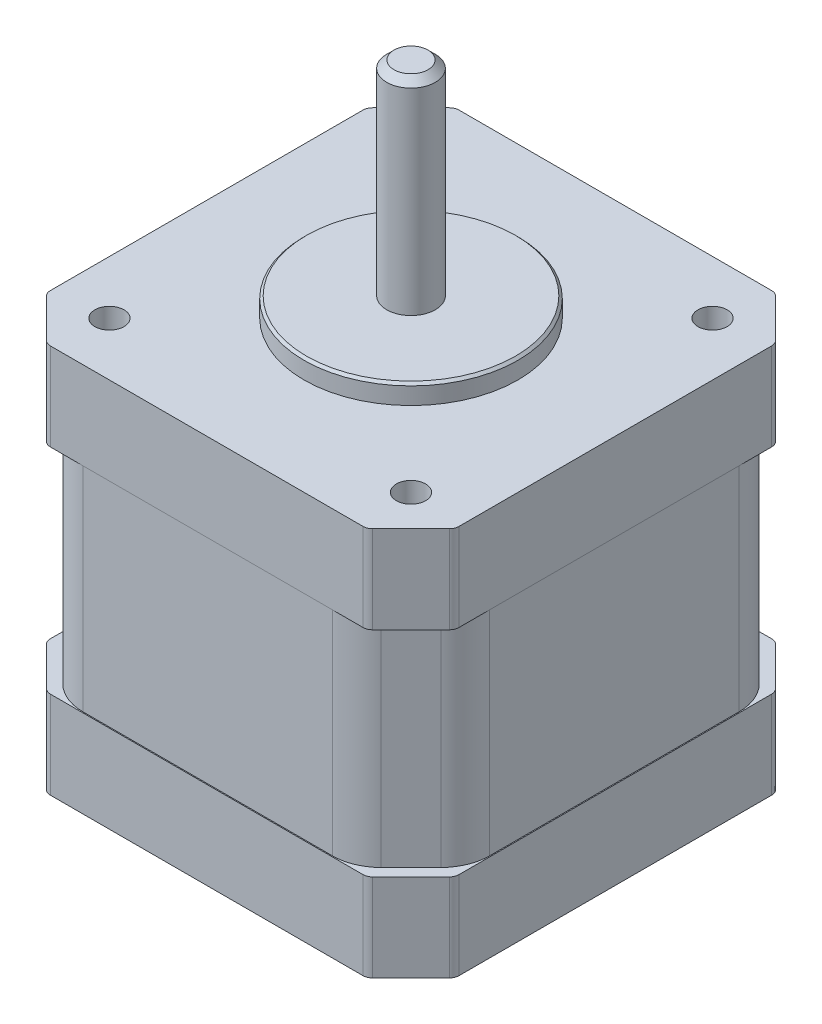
ISO-10303-21;
HEADER;
FILE_DESCRIPTION(('STEP AP214'),'2;1');
FILE_NAME('part.step','',(''),(''),'','','');
FILE_SCHEMA(('AUTOMOTIVE_DESIGN { 1 0 10303 214 1 1 1 1 }'));
ENDSEC;
DATA;
#1=APPLICATION_CONTEXT('core data for automotive mechanical design processes');
#2=APPLICATION_PROTOCOL_DEFINITION('international standard','automotive_design',2000,#1);
#3=PRODUCT_CONTEXT('',#1,'mechanical');
#4=PRODUCT('Part','Part','',(#3));
#5=PRODUCT_RELATED_PRODUCT_CATEGORY('part','',(#4));
#6=PRODUCT_DEFINITION_FORMATION('','',#4);
#7=PRODUCT_DEFINITION_CONTEXT('part definition',#1,'design');
#8=PRODUCT_DEFINITION('design','',#6,#7);
#9=PRODUCT_DEFINITION_SHAPE('','',#8);
#10=(LENGTH_UNIT() NAMED_UNIT(*) SI_UNIT(.MILLI.,.METRE.));
#11=(NAMED_UNIT(*) PLANE_ANGLE_UNIT() SI_UNIT($,.RADIAN.));
#12=(NAMED_UNIT(*) SI_UNIT($,.STERADIAN.) SOLID_ANGLE_UNIT());
#13=UNCERTAINTY_MEASURE_WITH_UNIT(LENGTH_MEASURE(1.E-05),#10,'distance_accuracy_value','');
#14=(GEOMETRIC_REPRESENTATION_CONTEXT(3) GLOBAL_UNCERTAINTY_ASSIGNED_CONTEXT((#13)) GLOBAL_UNIT_ASSIGNED_CONTEXT((#10,
#11,#12)) REPRESENTATION_CONTEXT('',''));
#15=CARTESIAN_POINT('',(0.,0.,0.));
#16=DIRECTION('',(0.,0.,1.));
#17=DIRECTION('',(1.,0.,0.));
#18=AXIS2_PLACEMENT_3D('',#15,#16,#17);
#19=CARTESIAN_POINT('',(15.5,0.,-15.5));
#20=DIRECTION('',(0.,1.,0.));
#21=DIRECTION('',(0.,0.,1.));
#22=AXIS2_PLACEMENT_3D('',#19,#20,#21);
#23=CYLINDRICAL_SURFACE('',#22,1.5);
#24=CARTESIAN_POINT('',(15.5,40.,-15.5));
#25=DIRECTION('',(0.,1.,0.));
#26=DIRECTION('',(0.,0.,1.));
#27=AXIS2_PLACEMENT_3D('',#24,#25,#26);
#28=CIRCLE('',#27,1.5);
#29=CARTESIAN_POINT('',(15.5,40.,-14.));
#30=VERTEX_POINT('',#29);
#31=EDGE_CURVE('E651',#30,#30,#28,.T.);
#32=ORIENTED_EDGE('',*,*,#31,.T.);
#33=EDGE_LOOP('',(#32));
#34=FACE_BOUND('',#33,.T.);
#35=CARTESIAN_POINT('',(15.5,1.3,-15.5));
#36=DIRECTION('',(0.,-1.,0.));
#37=DIRECTION('',(0.,0.,-1.));
#38=AXIS2_PLACEMENT_3D('',#35,#36,#37);
#39=CIRCLE('',#38,1.5);
#40=CARTESIAN_POINT('',(15.5,1.3,-17.));
#41=VERTEX_POINT('',#40);
#42=EDGE_CURVE('E40',#41,#41,#39,.F.);
#43=ORIENTED_EDGE('',*,*,#42,.F.);
#44=EDGE_LOOP('',(#43));
#45=FACE_BOUND('',#44,.T.);
#46=ADVANCED_FACE('F36',(#34,#45),#23,.F.);
#47=CARTESIAN_POINT('',(-15.5,0.,-15.5));
#48=DIRECTION('',(0.,1.,0.));
#49=DIRECTION('',(0.,0.,1.));
#50=AXIS2_PLACEMENT_3D('',#47,#48,#49);
#51=CYLINDRICAL_SURFACE('',#50,1.5);
#52=CARTESIAN_POINT('',(-15.5,40.,-15.5));
#53=DIRECTION('',(0.,1.,0.));
#54=DIRECTION('',(0.,0.,1.));
#55=AXIS2_PLACEMENT_3D('',#52,#53,#54);
#56=CIRCLE('',#55,1.5);
#57=CARTESIAN_POINT('',(-15.5,40.,-14.));
#58=VERTEX_POINT('',#57);
#59=EDGE_CURVE('E654',#58,#58,#56,.T.);
#60=ORIENTED_EDGE('',*,*,#59,.T.);
#61=EDGE_LOOP('',(#60));
#62=FACE_BOUND('',#61,.T.);
#63=CARTESIAN_POINT('',(-15.5,1.3,-15.5));
#64=DIRECTION('',(0.,-1.,0.));
#65=DIRECTION('',(0.,0.,-1.));
#66=AXIS2_PLACEMENT_3D('',#63,#64,#65);
#67=CIRCLE('',#66,1.5);
#68=CARTESIAN_POINT('',(-15.5,1.3,-17.));
#69=VERTEX_POINT('',#68);
#70=EDGE_CURVE('E624',#69,#69,#67,.F.);
#71=ORIENTED_EDGE('',*,*,#70,.F.);
#72=EDGE_LOOP('',(#71));
#73=FACE_BOUND('',#72,.T.);
#74=ADVANCED_FACE('F849',(#62,#73),#51,.F.);
#75=CARTESIAN_POINT('',(15.5,0.,15.5));
#76=DIRECTION('',(0.,1.,0.));
#77=DIRECTION('',(0.,0.,1.));
#78=AXIS2_PLACEMENT_3D('',#75,#76,#77);
#79=CYLINDRICAL_SURFACE('',#78,1.5);
#80=CARTESIAN_POINT('',(15.5,40.,15.5));
#81=DIRECTION('',(0.,1.,0.));
#82=DIRECTION('',(0.,0.,1.));
#83=AXIS2_PLACEMENT_3D('',#80,#81,#82);
#84=CIRCLE('',#83,1.5);
#85=CARTESIAN_POINT('',(15.5,40.,17.));
#86=VERTEX_POINT('',#85);
#87=EDGE_CURVE('E618',#86,#86,#84,.T.);
#88=ORIENTED_EDGE('',*,*,#87,.T.);
#89=EDGE_LOOP('',(#88));
#90=FACE_BOUND('',#89,.T.);
#91=CARTESIAN_POINT('',(15.5,1.3,15.5));
#92=DIRECTION('',(0.,-1.,0.));
#93=DIRECTION('',(0.,0.,-1.));
#94=AXIS2_PLACEMENT_3D('',#91,#92,#93);
#95=CIRCLE('',#94,1.5);
#96=CARTESIAN_POINT('',(15.5,1.3,14.));
#97=VERTEX_POINT('',#96);
#98=EDGE_CURVE('E620',#97,#97,#95,.F.);
#99=ORIENTED_EDGE('',*,*,#98,.F.);
#100=EDGE_LOOP('',(#99));
#101=FACE_BOUND('',#100,.T.);
#102=ADVANCED_FACE('F855',(#90,#101),#79,.F.);
#103=CARTESIAN_POINT('',(-15.5,0.,15.5));
#104=DIRECTION('',(0.,1.,0.));
#105=DIRECTION('',(0.,0.,1.));
#106=AXIS2_PLACEMENT_3D('',#103,#104,#105);
#107=CYLINDRICAL_SURFACE('',#106,1.5);
#108=CARTESIAN_POINT('',(-15.5,40.,15.5));
#109=DIRECTION('',(0.,1.,0.));
#110=DIRECTION('',(0.,0.,1.));
#111=AXIS2_PLACEMENT_3D('',#108,#109,#110);
#112=CIRCLE('',#111,1.5);
#113=CARTESIAN_POINT('',(-15.5,40.,17.));
#114=VERTEX_POINT('',#113);
#115=EDGE_CURVE('E657',#114,#114,#112,.T.);
#116=ORIENTED_EDGE('',*,*,#115,.T.);
#117=EDGE_LOOP('',(#116));
#118=FACE_BOUND('',#117,.T.);
#119=CARTESIAN_POINT('',(-15.5,1.3,15.5));
#120=DIRECTION('',(0.,-1.,0.));
#121=DIRECTION('',(0.,0.,-1.));
#122=AXIS2_PLACEMENT_3D('',#119,#120,#121);
#123=CIRCLE('',#122,1.5);
#124=CARTESIAN_POINT('',(-15.5,1.3,14.));
#125=VERTEX_POINT('',#124);
#126=EDGE_CURVE('E615',#125,#125,#123,.F.);
#127=ORIENTED_EDGE('',*,*,#126,.F.);
#128=EDGE_LOOP('',(#127));
#129=FACE_BOUND('',#128,.T.);
#130=ADVANCED_FACE('F862',(#118,#129),#107,.F.);
#131=CARTESIAN_POINT('',(0.,42.,0.));
#132=DIRECTION('',(0.,1.,0.));
#133=DIRECTION('',(0.,0.,1.));
#134=AXIS2_PLACEMENT_3D('',#131,#132,#133);
#135=PLANE('',#134);
#136=CARTESIAN_POINT('',(0.,42.,0.));
#137=DIRECTION('',(0.,1.,0.));
#138=DIRECTION('',(0.,0.,1.));
#139=AXIS2_PLACEMENT_3D('',#136,#137,#138);
#140=CIRCLE('',#139,10.75);
#141=CARTESIAN_POINT('',(0.,42.,10.75));
#142=VERTEX_POINT('',#141);
#143=EDGE_CURVE('E402',#142,#142,#140,.T.);
#144=ORIENTED_EDGE('',*,*,#143,.T.);
#145=EDGE_LOOP('',(#144));
#146=FACE_BOUND('',#145,.T.);
#147=CARTESIAN_POINT('',(0.,42.,0.));
#148=DIRECTION('',(0.,1.,0.));
#149=DIRECTION('',(0.,0.,1.));
#150=AXIS2_PLACEMENT_3D('',#147,#148,#149);
#151=CIRCLE('',#150,2.5);
#152=CARTESIAN_POINT('',(0.,42.,-2.5));
#153=VERTEX_POINT('',#152);
#154=EDGE_CURVE('E664',#153,#153,#151,.T.);
#155=ORIENTED_EDGE('',*,*,#154,.F.);
#156=EDGE_LOOP('',(#155));
#157=FACE_BOUND('',#156,.T.);
#158=ADVANCED_FACE('F865',(#146,#157),#135,.T.);
#159=CARTESIAN_POINT('',(0.,40.,0.));
#160=DIRECTION('',(0.,-1.,0.));
#161=DIRECTION('',(0.,0.,-1.));
#162=AXIS2_PLACEMENT_3D('',#159,#160,#161);
#163=PLANE('',#162);
#164=ORIENTED_EDGE('',*,*,#87,.F.);
#165=EDGE_LOOP('',(#164));
#166=FACE_BOUND('',#165,.T.);
#167=ORIENTED_EDGE('',*,*,#31,.F.);
#168=EDGE_LOOP('',(#167));
#169=FACE_BOUND('',#168,.T.);
#170=ORIENTED_EDGE('',*,*,#59,.F.);
#171=EDGE_LOOP('',(#170));
#172=FACE_BOUND('',#171,.T.);
#173=ORIENTED_EDGE('',*,*,#115,.F.);
#174=EDGE_LOOP('',(#173));
#175=FACE_BOUND('',#174,.T.);
#176=DIRECTION('',(-1.,0.,0.));
#177=VECTOR('',#176,1.);
#178=CARTESIAN_POINT('',(16.476659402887,40.,-21.));
#179=LINE('',#178,#177);
#180=CARTESIAN_POINT('',(16.0624458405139,40.,-21.));
#181=VERTEX_POINT('',#180);
#182=CARTESIAN_POINT('',(-16.0624458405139,40.,-21.));
#183=VERTEX_POINT('',#182);
#184=EDGE_CURVE('E692',#181,#183,#179,.T.);
#185=ORIENTED_EDGE('',*,*,#184,.T.);
#186=CARTESIAN_POINT('',(-16.0624458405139,40.,-20.));
#187=DIRECTION('',(0.,-1.,0.));
#188=DIRECTION('',(0.,0.,-1.));
#189=AXIS2_PLACEMENT_3D('',#186,#187,#188);
#190=CIRCLE('',#189,1.);
#191=CARTESIAN_POINT('',(-16.7695526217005,40.,-20.7071067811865));
#192=VERTEX_POINT('',#191);
#193=EDGE_CURVE('E515',#183,#192,#190,.F.);
#194=ORIENTED_EDGE('',*,*,#193,.T.);
#195=DIRECTION('',(-0.707106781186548,0.,0.707106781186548));
#196=VECTOR('',#195,1.);
#197=CARTESIAN_POINT('',(-16.476659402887,40.,-21.));
#198=LINE('',#197,#196);
#199=CARTESIAN_POINT('',(-20.7071067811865,40.,-16.7695526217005));
#200=VERTEX_POINT('',#199);
#201=EDGE_CURVE('E670',#192,#200,#198,.T.);
#202=ORIENTED_EDGE('',*,*,#201,.T.);
#203=CARTESIAN_POINT('',(-20.,40.,-16.0624458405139));
#204=DIRECTION('',(0.,-1.,0.));
#205=DIRECTION('',(0.,0.,-1.));
#206=AXIS2_PLACEMENT_3D('',#203,#204,#205);
#207=CIRCLE('',#206,1.);
#208=CARTESIAN_POINT('',(-21.,40.,-16.0624458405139));
#209=VERTEX_POINT('',#208);
#210=EDGE_CURVE('E513',#200,#209,#207,.F.);
#211=ORIENTED_EDGE('',*,*,#210,.T.);
#212=DIRECTION('',(0.,0.,1.));
#213=VECTOR('',#212,1.);
#214=CARTESIAN_POINT('',(-21.,40.,16.476659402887));
#215=LINE('',#214,#213);
#216=CARTESIAN_POINT('',(-21.,40.,16.0624458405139));
#217=VERTEX_POINT('',#216);
#218=EDGE_CURVE('E673',#209,#217,#215,.T.);
#219=ORIENTED_EDGE('',*,*,#218,.T.);
#220=CARTESIAN_POINT('',(-20.,40.,16.0624458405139));
#221=DIRECTION('',(0.,-1.,0.));
#222=DIRECTION('',(0.,0.,-1.));
#223=AXIS2_PLACEMENT_3D('',#220,#221,#222);
#224=CIRCLE('',#223,1.);
#225=CARTESIAN_POINT('',(-20.7071067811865,40.,16.7695526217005));
#226=VERTEX_POINT('',#225);
#227=EDGE_CURVE('E501',#217,#226,#224,.F.);
#228=ORIENTED_EDGE('',*,*,#227,.T.);
#229=DIRECTION('',(0.707106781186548,0.,0.707106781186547));
#230=VECTOR('',#229,1.);
#231=CARTESIAN_POINT('',(-16.476659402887,40.,21.));
#232=LINE('',#231,#230);
#233=CARTESIAN_POINT('',(-16.7695526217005,40.,20.7071067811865));
#234=VERTEX_POINT('',#233);
#235=EDGE_CURVE('E677',#226,#234,#232,.T.);
#236=ORIENTED_EDGE('',*,*,#235,.T.);
#237=CARTESIAN_POINT('',(-16.0624458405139,40.,20.));
#238=DIRECTION('',(0.,-1.,0.));
#239=DIRECTION('',(0.,0.,-1.));
#240=AXIS2_PLACEMENT_3D('',#237,#238,#239);
#241=CIRCLE('',#240,1.);
#242=CARTESIAN_POINT('',(-16.0624458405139,40.,21.));
#243=VERTEX_POINT('',#242);
#244=EDGE_CURVE('E503',#234,#243,#241,.F.);
#245=ORIENTED_EDGE('',*,*,#244,.T.);
#246=DIRECTION('',(1.,0.,0.));
#247=VECTOR('',#246,1.);
#248=CARTESIAN_POINT('',(16.476659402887,40.,21.));
#249=LINE('',#248,#247);
#250=CARTESIAN_POINT('',(16.0624458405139,40.,21.));
#251=VERTEX_POINT('',#250);
#252=EDGE_CURVE('E680',#243,#251,#249,.T.);
#253=ORIENTED_EDGE('',*,*,#252,.T.);
#254=CARTESIAN_POINT('',(16.0624458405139,40.,20.));
#255=DIRECTION('',(0.,-1.,0.));
#256=DIRECTION('',(0.,0.,-1.));
#257=AXIS2_PLACEMENT_3D('',#254,#255,#256);
#258=CIRCLE('',#257,1.);
#259=CARTESIAN_POINT('',(16.7695526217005,40.,20.7071067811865));
#260=VERTEX_POINT('',#259);
#261=EDGE_CURVE('E505',#251,#260,#258,.F.);
#262=ORIENTED_EDGE('',*,*,#261,.T.);
#263=DIRECTION('',(0.707106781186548,0.,-0.707106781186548));
#264=VECTOR('',#263,1.);
#265=CARTESIAN_POINT('',(21.,40.,16.476659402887));
#266=LINE('',#265,#264);
#267=CARTESIAN_POINT('',(20.7071067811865,40.,16.7695526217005));
#268=VERTEX_POINT('',#267);
#269=EDGE_CURVE('E683',#260,#268,#266,.T.);
#270=ORIENTED_EDGE('',*,*,#269,.T.);
#271=CARTESIAN_POINT('',(20.,40.,16.0624458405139));
#272=DIRECTION('',(0.,-1.,0.));
#273=DIRECTION('',(0.,0.,-1.));
#274=AXIS2_PLACEMENT_3D('',#271,#272,#273);
#275=CIRCLE('',#274,1.);
#276=CARTESIAN_POINT('',(21.,40.,16.0624458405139));
#277=VERTEX_POINT('',#276);
#278=EDGE_CURVE('E507',#268,#277,#275,.F.);
#279=ORIENTED_EDGE('',*,*,#278,.T.);
#280=DIRECTION('',(0.,0.,-1.));
#281=VECTOR('',#280,1.);
#282=CARTESIAN_POINT('',(21.,40.,16.476659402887));
#283=LINE('',#282,#281);
#284=CARTESIAN_POINT('',(21.,40.,-16.0624458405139));
#285=VERTEX_POINT('',#284);
#286=EDGE_CURVE('E686',#277,#285,#283,.T.);
#287=ORIENTED_EDGE('',*,*,#286,.T.);
#288=CARTESIAN_POINT('',(20.,40.,-16.0624458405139));
#289=DIRECTION('',(0.,-1.,0.));
#290=DIRECTION('',(0.,0.,-1.));
#291=AXIS2_PLACEMENT_3D('',#288,#289,#290);
#292=CIRCLE('',#291,1.);
#293=CARTESIAN_POINT('',(20.7071067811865,40.,-16.7695526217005));
#294=VERTEX_POINT('',#293);
#295=EDGE_CURVE('E509',#285,#294,#292,.F.);
#296=ORIENTED_EDGE('',*,*,#295,.T.);
#297=DIRECTION('',(-0.707106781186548,0.,-0.707106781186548));
#298=VECTOR('',#297,1.);
#299=CARTESIAN_POINT('',(21.,40.,-16.476659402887));
#300=LINE('',#299,#298);
#301=CARTESIAN_POINT('',(16.7695526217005,40.,-20.7071067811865));
#302=VERTEX_POINT('',#301);
#303=EDGE_CURVE('E689',#294,#302,#300,.T.);
#304=ORIENTED_EDGE('',*,*,#303,.T.);
#305=CARTESIAN_POINT('',(16.0624458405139,40.,-20.));
#306=DIRECTION('',(0.,-1.,0.));
#307=DIRECTION('',(0.,0.,-1.));
#308=AXIS2_PLACEMENT_3D('',#305,#306,#307);
#309=CIRCLE('',#308,1.);
#310=EDGE_CURVE('E511',#302,#181,#309,.F.);
#311=ORIENTED_EDGE('',*,*,#310,.T.);
#312=EDGE_LOOP('',(#185,#194,#202,#211,#219,#228,#236,#245,#253,#262,#270,#279,#287,#296,#304,#311));
#313=FACE_BOUND('',#312,.T.);
#314=CARTESIAN_POINT('',(0.,40.,0.));
#315=DIRECTION('',(0.,-1.,0.));
#316=DIRECTION('',(0.,0.,-1.));
#317=AXIS2_PLACEMENT_3D('',#314,#315,#316);
#318=CIRCLE('',#317,11.);
#319=CARTESIAN_POINT('',(0.,40.,-11.));
#320=VERTEX_POINT('',#319);
#321=EDGE_CURVE('E399',#320,#320,#318,.F.);
#322=ORIENTED_EDGE('',*,*,#321,.F.);
#323=EDGE_LOOP('',(#322));
#324=FACE_BOUND('',#323,.T.);
#325=ADVANCED_FACE('F888',(#166,#169,#172,#175,#313,#324),#163,.F.);
#326=CARTESIAN_POINT('',(0.,9.,0.));
#327=DIRECTION('',(0.,-1.,0.));
#328=DIRECTION('',(0.,0.,-1.));
#329=AXIS2_PLACEMENT_3D('',#326,#327,#328);
#330=PLANE('',#329);
#331=DIRECTION('',(-0.707106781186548,0.,-0.707106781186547));
#332=VECTOR('',#331,1.);
#333=CARTESIAN_POINT('',(21.,9.,-16.476659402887));
#334=LINE('',#333,#332);
#335=CARTESIAN_POINT('',(20.7071067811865,9.,-16.7695526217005));
#336=VERTEX_POINT('',#335);
#337=CARTESIAN_POINT('',(16.7695526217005,9.,-20.7071067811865));
#338=VERTEX_POINT('',#337);
#339=EDGE_CURVE('E380',#336,#338,#334,.T.);
#340=ORIENTED_EDGE('',*,*,#339,.T.);
#341=CARTESIAN_POINT('',(16.0624458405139,9.,-20.));
#342=DIRECTION('',(0.,-1.,0.));
#343=DIRECTION('',(0.,0.,-1.));
#344=AXIS2_PLACEMENT_3D('',#341,#342,#343);
#345=CIRCLE('',#344,1.);
#346=CARTESIAN_POINT('',(16.0624458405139,9.,-21.));
#347=VERTEX_POINT('',#346);
#348=EDGE_CURVE('E443',#338,#347,#345,.F.);
#349=ORIENTED_EDGE('',*,*,#348,.T.);
#350=DIRECTION('',(-1.,0.,0.));
#351=VECTOR('',#350,1.);
#352=CARTESIAN_POINT('',(16.476659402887,9.,-21.));
#353=LINE('',#352,#351);
#354=CARTESIAN_POINT('',(-16.0624458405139,9.,-21.));
#355=VERTEX_POINT('',#354);
#356=EDGE_CURVE('E363',#347,#355,#353,.T.);
#357=ORIENTED_EDGE('',*,*,#356,.T.);
#358=CARTESIAN_POINT('',(-16.0624458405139,9.,-20.));
#359=DIRECTION('',(0.,-1.,0.));
#360=DIRECTION('',(0.,0.,-1.));
#361=AXIS2_PLACEMENT_3D('',#358,#359,#360);
#362=CIRCLE('',#361,1.);
#363=CARTESIAN_POINT('',(-16.7695526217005,9.,-20.7071067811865));
#364=VERTEX_POINT('',#363);
#365=EDGE_CURVE('E431',#355,#364,#362,.F.);
#366=ORIENTED_EDGE('',*,*,#365,.T.);
#367=DIRECTION('',(-0.707106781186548,0.,0.707106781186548));
#368=VECTOR('',#367,1.);
#369=CARTESIAN_POINT('',(-16.476659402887,9.,-21.));
#370=LINE('',#369,#368);
#371=CARTESIAN_POINT('',(-20.7071067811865,9.,-16.7695526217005));
#372=VERTEX_POINT('',#371);
#373=EDGE_CURVE('E759',#364,#372,#370,.T.);
#374=ORIENTED_EDGE('',*,*,#373,.T.);
#375=CARTESIAN_POINT('',(-20.,9.,-16.0624458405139));
#376=DIRECTION('',(0.,-1.,0.));
#377=DIRECTION('',(0.,0.,-1.));
#378=AXIS2_PLACEMENT_3D('',#375,#376,#377);
#379=CIRCLE('',#378,1.);
#380=CARTESIAN_POINT('',(-21.,9.,-16.0624458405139));
#381=VERTEX_POINT('',#380);
#382=EDGE_CURVE('E429',#372,#381,#379,.F.);
#383=ORIENTED_EDGE('',*,*,#382,.T.);
#384=DIRECTION('',(0.,0.,1.));
#385=VECTOR('',#384,1.);
#386=CARTESIAN_POINT('',(-21.,9.,16.476659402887));
#387=LINE('',#386,#385);
#388=CARTESIAN_POINT('',(-21.,9.,16.0624458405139));
#389=VERTEX_POINT('',#388);
#390=EDGE_CURVE('E762',#381,#389,#387,.T.);
#391=ORIENTED_EDGE('',*,*,#390,.T.);
#392=CARTESIAN_POINT('',(-20.,9.,16.0624458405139));
#393=DIRECTION('',(0.,-1.,0.));
#394=DIRECTION('',(0.,0.,-1.));
#395=AXIS2_PLACEMENT_3D('',#392,#393,#394);
#396=CIRCLE('',#395,1.);
#397=CARTESIAN_POINT('',(-20.7071067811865,9.,16.7695526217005));
#398=VERTEX_POINT('',#397);
#399=EDGE_CURVE('E433',#389,#398,#396,.F.);
#400=ORIENTED_EDGE('',*,*,#399,.T.);
#401=DIRECTION('',(0.707106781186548,0.,0.707106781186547));
#402=VECTOR('',#401,1.);
#403=CARTESIAN_POINT('',(-16.476659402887,9.,21.));
#404=LINE('',#403,#402);
#405=CARTESIAN_POINT('',(-16.7695526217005,9.,20.7071067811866));
#406=VERTEX_POINT('',#405);
#407=EDGE_CURVE('E765',#398,#406,#404,.T.);
#408=ORIENTED_EDGE('',*,*,#407,.T.);
#409=CARTESIAN_POINT('',(-16.0624458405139,9.,20.));
#410=DIRECTION('',(0.,-1.,0.));
#411=DIRECTION('',(0.,0.,-1.));
#412=AXIS2_PLACEMENT_3D('',#409,#410,#411);
#413=CIRCLE('',#412,1.);
#414=CARTESIAN_POINT('',(-16.0624458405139,9.,21.));
#415=VERTEX_POINT('',#414);
#416=EDGE_CURVE('E435',#406,#415,#413,.F.);
#417=ORIENTED_EDGE('',*,*,#416,.T.);
#418=DIRECTION('',(1.,0.,0.));
#419=VECTOR('',#418,1.);
#420=CARTESIAN_POINT('',(16.476659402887,9.,21.));
#421=LINE('',#420,#419);
#422=CARTESIAN_POINT('',(16.0624458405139,9.,21.));
#423=VERTEX_POINT('',#422);
#424=EDGE_CURVE('E768',#415,#423,#421,.T.);
#425=ORIENTED_EDGE('',*,*,#424,.T.);
#426=CARTESIAN_POINT('',(16.0624458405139,9.,20.));
#427=DIRECTION('',(0.,-1.,0.));
#428=DIRECTION('',(0.,0.,-1.));
#429=AXIS2_PLACEMENT_3D('',#426,#427,#428);
#430=CIRCLE('',#429,1.);
#431=CARTESIAN_POINT('',(16.7695526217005,9.,20.7071067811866));
#432=VERTEX_POINT('',#431);
#433=EDGE_CURVE('E437',#423,#432,#430,.F.);
#434=ORIENTED_EDGE('',*,*,#433,.T.);
#435=DIRECTION('',(0.707106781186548,0.,-0.707106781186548));
#436=VECTOR('',#435,1.);
#437=CARTESIAN_POINT('',(21.,9.,16.476659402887));
#438=LINE('',#437,#436);
#439=CARTESIAN_POINT('',(20.7071067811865,9.,16.7695526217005));
#440=VERTEX_POINT('',#439);
#441=EDGE_CURVE('E771',#432,#440,#438,.T.);
#442=ORIENTED_EDGE('',*,*,#441,.T.);
#443=CARTESIAN_POINT('',(20.,9.,16.0624458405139));
#444=DIRECTION('',(0.,-1.,0.));
#445=DIRECTION('',(0.,0.,-1.));
#446=AXIS2_PLACEMENT_3D('',#443,#444,#445);
#447=CIRCLE('',#446,1.);
#448=CARTESIAN_POINT('',(21.,9.,16.0624458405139));
#449=VERTEX_POINT('',#448);
#450=EDGE_CURVE('E439',#440,#449,#447,.F.);
#451=ORIENTED_EDGE('',*,*,#450,.T.);
#452=DIRECTION('',(0.,0.,-1.));
#453=VECTOR('',#452,1.);
#454=CARTESIAN_POINT('',(21.,9.,16.476659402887));
#455=LINE('',#454,#453);
#456=CARTESIAN_POINT('',(21.,9.,-16.0624458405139));
#457=VERTEX_POINT('',#456);
#458=EDGE_CURVE('E773',#449,#457,#455,.T.);
#459=ORIENTED_EDGE('',*,*,#458,.T.);
#460=CARTESIAN_POINT('',(20.,9.,-16.0624458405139));
#461=DIRECTION('',(0.,-1.,0.));
#462=DIRECTION('',(0.,0.,-1.));
#463=AXIS2_PLACEMENT_3D('',#460,#461,#462);
#464=CIRCLE('',#463,1.);
#465=EDGE_CURVE('E441',#457,#336,#464,.F.);
#466=ORIENTED_EDGE('',*,*,#465,.T.);
#467=EDGE_LOOP('',(#340,#349,#357,#366,#374,#383,#391,#400,#408,#417,#425,#434,#442,#451,#459,#466));
#468=FACE_BOUND('',#467,.T.);
#469=DIRECTION('',(-0.707106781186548,0.,0.707106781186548));
#470=VECTOR('',#469,1.);
#471=CARTESIAN_POINT('',(-14.9,9.,-20.9));
#472=LINE('',#471,#470);
#473=CARTESIAN_POINT('',(-16.3644660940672,9.,-19.4355339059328));
#474=VERTEX_POINT('',#473);
#475=CARTESIAN_POINT('',(-19.4355339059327,9.,-16.3644660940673));
#476=VERTEX_POINT('',#475);
#477=EDGE_CURVE('E695',#474,#476,#472,.T.);
#478=ORIENTED_EDGE('',*,*,#477,.F.);
#479=CARTESIAN_POINT('',(-12.8289321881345,9.,-15.9));
#480=DIRECTION('',(0.,-1.,0.));
#481=DIRECTION('',(0.,0.,-1.));
#482=AXIS2_PLACEMENT_3D('',#479,#480,#481);
#483=CIRCLE('',#482,5.);
#484=CARTESIAN_POINT('',(-12.8289321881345,9.,-20.9));
#485=VERTEX_POINT('',#484);
#486=EDGE_CURVE('E598',#474,#485,#483,.T.);
#487=ORIENTED_EDGE('',*,*,#486,.T.);
#488=DIRECTION('',(-1.,0.,0.));
#489=VECTOR('',#488,1.);
#490=CARTESIAN_POINT('',(14.9,9.,-20.9));
#491=LINE('',#490,#489);
#492=CARTESIAN_POINT('',(12.8289321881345,9.,-20.9));
#493=VERTEX_POINT('',#492);
#494=EDGE_CURVE('E722',#493,#485,#491,.T.);
#495=ORIENTED_EDGE('',*,*,#494,.F.);
#496=CARTESIAN_POINT('',(12.8289321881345,9.,-15.9));
#497=DIRECTION('',(0.,-1.,0.));
#498=DIRECTION('',(0.,0.,-1.));
#499=AXIS2_PLACEMENT_3D('',#496,#497,#498);
#500=CIRCLE('',#499,5.);
#501=CARTESIAN_POINT('',(16.3644660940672,9.,-19.4355339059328));
#502=VERTEX_POINT('',#501);
#503=EDGE_CURVE('E602',#493,#502,#500,.T.);
#504=ORIENTED_EDGE('',*,*,#503,.T.);
#505=DIRECTION('',(-0.707106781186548,0.,-0.707106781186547));
#506=VECTOR('',#505,1.);
#507=CARTESIAN_POINT('',(20.9,9.,-14.9));
#508=LINE('',#507,#506);
#509=CARTESIAN_POINT('',(19.4355339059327,9.,-16.3644660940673));
#510=VERTEX_POINT('',#509);
#511=EDGE_CURVE('E753',#510,#502,#508,.T.);
#512=ORIENTED_EDGE('',*,*,#511,.F.);
#513=CARTESIAN_POINT('',(15.9,9.,-12.8289321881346));
#514=DIRECTION('',(0.,-1.,0.));
#515=DIRECTION('',(0.,0.,-1.));
#516=AXIS2_PLACEMENT_3D('',#513,#514,#515);
#517=CIRCLE('',#516,5.);
#518=CARTESIAN_POINT('',(20.9,9.,-12.8289321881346));
#519=VERTEX_POINT('',#518);
#520=EDGE_CURVE('E606',#510,#519,#517,.T.);
#521=ORIENTED_EDGE('',*,*,#520,.T.);
#522=DIRECTION('',(0.,0.,-1.));
#523=VECTOR('',#522,1.);
#524=CARTESIAN_POINT('',(20.9,9.,14.9));
#525=LINE('',#524,#523);
#526=CARTESIAN_POINT('',(20.9,9.,12.8289321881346));
#527=VERTEX_POINT('',#526);
#528=EDGE_CURVE('E750',#527,#519,#525,.T.);
#529=ORIENTED_EDGE('',*,*,#528,.F.);
#530=CARTESIAN_POINT('',(15.9,9.,12.8289321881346));
#531=DIRECTION('',(0.,-1.,0.));
#532=DIRECTION('',(0.,0.,-1.));
#533=AXIS2_PLACEMENT_3D('',#530,#531,#532);
#534=CIRCLE('',#533,5.);
#535=CARTESIAN_POINT('',(19.4355339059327,9.,16.3644660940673));
#536=VERTEX_POINT('',#535);
#537=EDGE_CURVE('E610',#527,#536,#534,.T.);
#538=ORIENTED_EDGE('',*,*,#537,.T.);
#539=DIRECTION('',(0.707106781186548,0.,-0.707106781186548));
#540=VECTOR('',#539,1.);
#541=CARTESIAN_POINT('',(20.9,9.,14.9));
#542=LINE('',#541,#540);
#543=CARTESIAN_POINT('',(16.3644660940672,9.,19.4355339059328));
#544=VERTEX_POINT('',#543);
#545=EDGE_CURVE('E748',#544,#536,#542,.T.);
#546=ORIENTED_EDGE('',*,*,#545,.F.);
#547=CARTESIAN_POINT('',(12.8289321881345,9.,15.9));
#548=DIRECTION('',(0.,-1.,0.));
#549=DIRECTION('',(0.,0.,-1.));
#550=AXIS2_PLACEMENT_3D('',#547,#548,#549);
#551=CIRCLE('',#550,5.);
#552=CARTESIAN_POINT('',(12.8289321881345,9.,20.9));
#553=VERTEX_POINT('',#552);
#554=EDGE_CURVE('E45',#544,#553,#551,.T.);
#555=ORIENTED_EDGE('',*,*,#554,.T.);
#556=DIRECTION('',(1.,0.,0.));
#557=VECTOR('',#556,1.);
#558=CARTESIAN_POINT('',(14.9,9.,20.9));
#559=LINE('',#558,#557);
#560=CARTESIAN_POINT('',(-12.8289321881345,9.,20.9));
#561=VERTEX_POINT('',#560);
#562=EDGE_CURVE('E745',#561,#553,#559,.T.);
#563=ORIENTED_EDGE('',*,*,#562,.F.);
#564=CARTESIAN_POINT('',(-12.8289321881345,9.,15.9));
#565=DIRECTION('',(0.,-1.,0.));
#566=DIRECTION('',(0.,0.,-1.));
#567=AXIS2_PLACEMENT_3D('',#564,#565,#566);
#568=CIRCLE('',#567,5.);
#569=CARTESIAN_POINT('',(-16.3644660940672,9.,19.4355339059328));
#570=VERTEX_POINT('',#569);
#571=EDGE_CURVE('E586',#561,#570,#568,.T.);
#572=ORIENTED_EDGE('',*,*,#571,.T.);
#573=DIRECTION('',(0.707106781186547,0.,0.707106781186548));
#574=VECTOR('',#573,1.);
#575=CARTESIAN_POINT('',(-14.9,9.,20.9));
#576=LINE('',#575,#574);
#577=CARTESIAN_POINT('',(-19.4355339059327,9.,16.3644660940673));
#578=VERTEX_POINT('',#577);
#579=EDGE_CURVE('E742',#578,#570,#576,.T.);
#580=ORIENTED_EDGE('',*,*,#579,.F.);
#581=CARTESIAN_POINT('',(-15.9,9.,12.8289321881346));
#582=DIRECTION('',(0.,-1.,0.));
#583=DIRECTION('',(0.,0.,-1.));
#584=AXIS2_PLACEMENT_3D('',#581,#582,#583);
#585=CIRCLE('',#584,5.);
#586=CARTESIAN_POINT('',(-20.9,9.,12.8289321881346));
#587=VERTEX_POINT('',#586);
#588=EDGE_CURVE('E590',#578,#587,#585,.T.);
#589=ORIENTED_EDGE('',*,*,#588,.T.);
#590=DIRECTION('',(0.,0.,1.));
#591=VECTOR('',#590,1.);
#592=CARTESIAN_POINT('',(-20.9,9.,14.9));
#593=LINE('',#592,#591);
#594=CARTESIAN_POINT('',(-20.9,9.,-12.8289321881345));
#595=VERTEX_POINT('',#594);
#596=EDGE_CURVE('E739',#595,#587,#593,.T.);
#597=ORIENTED_EDGE('',*,*,#596,.F.);
#598=CARTESIAN_POINT('',(-15.9,9.,-12.8289321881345));
#599=DIRECTION('',(0.,-1.,0.));
#600=DIRECTION('',(0.,0.,-1.));
#601=AXIS2_PLACEMENT_3D('',#598,#599,#600);
#602=CIRCLE('',#601,5.);
#603=EDGE_CURVE('E594',#595,#476,#602,.T.);
#604=ORIENTED_EDGE('',*,*,#603,.T.);
#605=EDGE_LOOP('',(#478,#487,#495,#504,#512,#521,#529,#538,#546,#555,#563,#572,#580,#589,#597,#604));
#606=FACE_BOUND('',#605,.T.);
#607=ADVANCED_FACE('F780',(#468,#606),#330,.F.);
#608=CARTESIAN_POINT('',(16.476659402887,9.,-21.));
#609=DIRECTION('',(0.,0.,1.));
#610=DIRECTION('',(1.,0.,0.));
#611=AXIS2_PLACEMENT_3D('',#608,#609,#610);
#612=PLANE('',#611);
#613=ORIENTED_EDGE('',*,*,#356,.F.);
#614=DIRECTION('',(0.,-1.,0.));
#615=VECTOR('',#614,1.);
#616=CARTESIAN_POINT('',(16.0624458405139,9.,-21.));
#617=LINE('',#616,#615);
#618=CARTESIAN_POINT('',(16.0624458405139,0.,-21.));
#619=VERTEX_POINT('',#618);
#620=EDGE_CURVE('E347',#347,#619,#617,.T.);
#621=ORIENTED_EDGE('',*,*,#620,.T.);
#622=DIRECTION('',(-1.,0.,0.));
#623=VECTOR('',#622,1.);
#624=CARTESIAN_POINT('',(16.476659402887,0.,-21.));
#625=LINE('',#624,#623);
#626=CARTESIAN_POINT('',(-16.0624458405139,0.,-21.));
#627=VERTEX_POINT('',#626);
#628=EDGE_CURVE('E360',#619,#627,#625,.T.);
#629=ORIENTED_EDGE('',*,*,#628,.T.);
#630=DIRECTION('',(0.,-1.,0.));
#631=VECTOR('',#630,1.);
#632=CARTESIAN_POINT('',(-16.0624458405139,9.,-21.));
#633=LINE('',#632,#631);
#634=EDGE_CURVE('E365',#627,#355,#633,.F.);
#635=ORIENTED_EDGE('',*,*,#634,.T.);
#636=EDGE_LOOP('',(#613,#621,#629,#635));
#637=FACE_BOUND('',#636,.T.);
#638=ADVANCED_FACE('F359',(#637),#612,.F.);
#639=CARTESIAN_POINT('',(-16.476659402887,9.,-21.));
#640=DIRECTION('',(0.707106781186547,0.,0.707106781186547));
#641=DIRECTION('',(0.707106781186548,0.,-0.707106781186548));
#642=AXIS2_PLACEMENT_3D('',#639,#640,#641);
#643=PLANE('',#642);
#644=ORIENTED_EDGE('',*,*,#373,.F.);
#645=DIRECTION('',(0.,-1.,0.));
#646=VECTOR('',#645,1.);
#647=CARTESIAN_POINT('',(-16.7695526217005,9.,-20.7071067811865));
#648=LINE('',#647,#646);
#649=CARTESIAN_POINT('',(-16.7695526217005,0.,-20.7071067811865));
#650=VERTEX_POINT('',#649);
#651=EDGE_CURVE('E472',#364,#650,#648,.T.);
#652=ORIENTED_EDGE('',*,*,#651,.T.);
#653=DIRECTION('',(-0.707106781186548,0.,0.707106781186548));
#654=VECTOR('',#653,1.);
#655=CARTESIAN_POINT('',(-16.476659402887,0.,-21.));
#656=LINE('',#655,#654);
#657=CARTESIAN_POINT('',(-20.7071067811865,0.,-16.7695526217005));
#658=VERTEX_POINT('',#657);
#659=EDGE_CURVE('E370',#650,#658,#656,.T.);
#660=ORIENTED_EDGE('',*,*,#659,.T.);
#661=DIRECTION('',(0.,-1.,0.));
#662=VECTOR('',#661,1.);
#663=CARTESIAN_POINT('',(-20.7071067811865,9.,-16.7695526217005));
#664=LINE('',#663,#662);
#665=EDGE_CURVE('E470',#658,#372,#664,.F.);
#666=ORIENTED_EDGE('',*,*,#665,.T.);
#667=EDGE_LOOP('',(#644,#652,#660,#666));
#668=FACE_BOUND('',#667,.T.);
#669=ADVANCED_FACE('F834',(#668),#643,.F.);
#670=CARTESIAN_POINT('',(-21.,9.,16.476659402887));
#671=DIRECTION('',(1.,0.,0.));
#672=DIRECTION('',(0.,0.,-1.));
#673=AXIS2_PLACEMENT_3D('',#670,#671,#672);
#674=PLANE('',#673);
#675=DIRECTION('',(0.,0.,1.));
#676=VECTOR('',#675,1.);
#677=CARTESIAN_POINT('',(-21.,0.,16.476659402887));
#678=LINE('',#677,#676);
#679=CARTESIAN_POINT('',(-21.,0.,-16.0624458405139));
#680=VERTEX_POINT('',#679);
#681=CARTESIAN_POINT('',(-21.,0.,16.0624458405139));
#682=VERTEX_POINT('',#681);
#683=EDGE_CURVE('E374',#680,#682,#678,.T.);
#684=ORIENTED_EDGE('',*,*,#683,.T.);
#685=DIRECTION('',(0.,-1.,0.));
#686=VECTOR('',#685,1.);
#687=CARTESIAN_POINT('',(-21.,9.,16.0624458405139));
#688=LINE('',#687,#686);
#689=EDGE_CURVE('E468',#682,#389,#688,.F.);
#690=ORIENTED_EDGE('',*,*,#689,.T.);
#691=ORIENTED_EDGE('',*,*,#390,.F.);
#692=DIRECTION('',(0.,-1.,0.));
#693=VECTOR('',#692,1.);
#694=CARTESIAN_POINT('',(-21.,9.,-16.0624458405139));
#695=LINE('',#694,#693);
#696=EDGE_CURVE('E465',#381,#680,#695,.T.);
#697=ORIENTED_EDGE('',*,*,#696,.T.);
#698=EDGE_LOOP('',(#684,#690,#691,#697));
#699=FACE_BOUND('',#698,.T.);
#700=ADVANCED_FACE('F825',(#699),#674,.F.);
#701=CARTESIAN_POINT('',(-16.476659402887,9.,21.));
#702=DIRECTION('',(0.707106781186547,0.,-0.707106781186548));
#703=DIRECTION('',(-0.707106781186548,0.,-0.707106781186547));
#704=AXIS2_PLACEMENT_3D('',#701,#702,#703);
#705=PLANE('',#704);
#706=DIRECTION('',(0.707106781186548,0.,0.707106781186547));
#707=VECTOR('',#706,1.);
#708=CARTESIAN_POINT('',(-16.476659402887,0.,21.));
#709=LINE('',#708,#707);
#710=CARTESIAN_POINT('',(-20.7071067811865,0.,16.7695526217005));
#711=VERTEX_POINT('',#710);
#712=CARTESIAN_POINT('',(-16.7695526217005,0.,20.7071067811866));
#713=VERTEX_POINT('',#712);
#714=EDGE_CURVE('E385',#711,#713,#709,.T.);
#715=ORIENTED_EDGE('',*,*,#714,.T.);
#716=DIRECTION('',(0.,-1.,0.));
#717=VECTOR('',#716,1.);
#718=CARTESIAN_POINT('',(-16.7695526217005,9.,20.7071067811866));
#719=LINE('',#718,#717);
#720=EDGE_CURVE('E463',#713,#406,#719,.F.);
#721=ORIENTED_EDGE('',*,*,#720,.T.);
#722=ORIENTED_EDGE('',*,*,#407,.F.);
#723=DIRECTION('',(0.,-1.,0.));
#724=VECTOR('',#723,1.);
#725=CARTESIAN_POINT('',(-20.7071067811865,9.,16.7695526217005));
#726=LINE('',#725,#724);
#727=EDGE_CURVE('E460',#398,#711,#726,.T.);
#728=ORIENTED_EDGE('',*,*,#727,.T.);
#729=EDGE_LOOP('',(#715,#721,#722,#728));
#730=FACE_BOUND('',#729,.T.);
#731=ADVANCED_FACE('F816',(#730),#705,.F.);
#732=CARTESIAN_POINT('',(16.476659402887,9.,21.));
#733=DIRECTION('',(0.,0.,-1.));
#734=DIRECTION('',(-1.,0.,0.));
#735=AXIS2_PLACEMENT_3D('',#732,#733,#734);
#736=PLANE('',#735);
#737=DIRECTION('',(1.,0.,0.));
#738=VECTOR('',#737,1.);
#739=CARTESIAN_POINT('',(16.476659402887,0.,21.));
#740=LINE('',#739,#738);
#741=CARTESIAN_POINT('',(-16.0624458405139,0.,21.));
#742=VERTEX_POINT('',#741);
#743=CARTESIAN_POINT('',(16.0624458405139,0.,21.));
#744=VERTEX_POINT('',#743);
#745=EDGE_CURVE('E388',#742,#744,#740,.T.);
#746=ORIENTED_EDGE('',*,*,#745,.T.);
#747=DIRECTION('',(0.,-1.,0.));
#748=VECTOR('',#747,1.);
#749=CARTESIAN_POINT('',(16.0624458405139,9.,21.));
#750=LINE('',#749,#748);
#751=EDGE_CURVE('E458',#744,#423,#750,.F.);
#752=ORIENTED_EDGE('',*,*,#751,.T.);
#753=ORIENTED_EDGE('',*,*,#424,.F.);
#754=DIRECTION('',(0.,-1.,0.));
#755=VECTOR('',#754,1.);
#756=CARTESIAN_POINT('',(-16.0624458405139,9.,21.));
#757=LINE('',#756,#755);
#758=EDGE_CURVE('E455',#415,#742,#757,.T.);
#759=ORIENTED_EDGE('',*,*,#758,.T.);
#760=EDGE_LOOP('',(#746,#752,#753,#759));
#761=FACE_BOUND('',#760,.T.);
#762=ADVANCED_FACE('F807',(#761),#736,.F.);
#763=CARTESIAN_POINT('',(21.,9.,16.476659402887));
#764=DIRECTION('',(-0.707106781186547,0.,-0.707106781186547));
#765=DIRECTION('',(-0.707106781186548,0.,0.707106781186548));
#766=AXIS2_PLACEMENT_3D('',#763,#764,#765);
#767=PLANE('',#766);
#768=DIRECTION('',(0.707106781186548,0.,-0.707106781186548));
#769=VECTOR('',#768,1.);
#770=CARTESIAN_POINT('',(21.,0.,16.476659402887));
#771=LINE('',#770,#769);
#772=CARTESIAN_POINT('',(16.7695526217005,0.,20.7071067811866));
#773=VERTEX_POINT('',#772);
#774=CARTESIAN_POINT('',(20.7071067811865,0.,16.7695526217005));
#775=VERTEX_POINT('',#774);
#776=EDGE_CURVE('E391',#773,#775,#771,.T.);
#777=ORIENTED_EDGE('',*,*,#776,.T.);
#778=DIRECTION('',(0.,-1.,0.));
#779=VECTOR('',#778,1.);
#780=CARTESIAN_POINT('',(20.7071067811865,9.,16.7695526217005));
#781=LINE('',#780,#779);
#782=EDGE_CURVE('E453',#775,#440,#781,.F.);
#783=ORIENTED_EDGE('',*,*,#782,.T.);
#784=ORIENTED_EDGE('',*,*,#441,.F.);
#785=DIRECTION('',(0.,-1.,0.));
#786=VECTOR('',#785,1.);
#787=CARTESIAN_POINT('',(16.7695526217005,9.,20.7071067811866));
#788=LINE('',#787,#786);
#789=EDGE_CURVE('E450',#432,#773,#788,.T.);
#790=ORIENTED_EDGE('',*,*,#789,.T.);
#791=EDGE_LOOP('',(#777,#783,#784,#790));
#792=FACE_BOUND('',#791,.T.);
#793=ADVANCED_FACE('F798',(#792),#767,.F.);
#794=CARTESIAN_POINT('',(21.,9.,16.476659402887));
#795=DIRECTION('',(-1.,0.,0.));
#796=DIRECTION('',(0.,0.,1.));
#797=AXIS2_PLACEMENT_3D('',#794,#795,#796);
#798=PLANE('',#797);
#799=DIRECTION('',(0.,0.,-1.));
#800=VECTOR('',#799,1.);
#801=CARTESIAN_POINT('',(21.,0.,16.476659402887));
#802=LINE('',#801,#800);
#803=CARTESIAN_POINT('',(21.,0.,16.0624458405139));
#804=VERTEX_POINT('',#803);
#805=CARTESIAN_POINT('',(21.,0.,-16.0624458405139));
#806=VERTEX_POINT('',#805);
#807=EDGE_CURVE('E394',#804,#806,#802,.T.);
#808=ORIENTED_EDGE('',*,*,#807,.T.);
#809=DIRECTION('',(0.,-1.,0.));
#810=VECTOR('',#809,1.);
#811=CARTESIAN_POINT('',(21.,9.,-16.0624458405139));
#812=LINE('',#811,#810);
#813=EDGE_CURVE('E448',#806,#457,#812,.F.);
#814=ORIENTED_EDGE('',*,*,#813,.T.);
#815=ORIENTED_EDGE('',*,*,#458,.F.);
#816=DIRECTION('',(0.,-1.,0.));
#817=VECTOR('',#816,1.);
#818=CARTESIAN_POINT('',(21.,9.,16.0624458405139));
#819=LINE('',#818,#817);
#820=EDGE_CURVE('E445',#449,#804,#819,.T.);
#821=ORIENTED_EDGE('',*,*,#820,.T.);
#822=EDGE_LOOP('',(#808,#814,#815,#821));
#823=FACE_BOUND('',#822,.T.);
#824=ADVANCED_FACE('F790',(#823),#798,.F.);
#825=CARTESIAN_POINT('',(21.,9.,-16.476659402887));
#826=DIRECTION('',(-0.707106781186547,0.,0.707106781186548));
#827=DIRECTION('',(0.707106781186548,0.,0.707106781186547));
#828=AXIS2_PLACEMENT_3D('',#825,#826,#827);
#829=PLANE('',#828);
#830=DIRECTION('',(-0.707106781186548,0.,-0.707106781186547));
#831=VECTOR('',#830,1.);
#832=CARTESIAN_POINT('',(21.,0.,-16.476659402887));
#833=LINE('',#832,#831);
#834=CARTESIAN_POINT('',(20.7071067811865,0.,-16.7695526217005));
#835=VERTEX_POINT('',#834);
#836=CARTESIAN_POINT('',(16.7695526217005,0.,-20.7071067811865));
#837=VERTEX_POINT('',#836);
#838=EDGE_CURVE('E397',#835,#837,#833,.T.);
#839=ORIENTED_EDGE('',*,*,#838,.T.);
#840=DIRECTION('',(0.,-1.,0.));
#841=VECTOR('',#840,1.);
#842=CARTESIAN_POINT('',(16.7695526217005,9.,-20.7071067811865));
#843=LINE('',#842,#841);
#844=EDGE_CURVE('E348',#837,#338,#843,.F.);
#845=ORIENTED_EDGE('',*,*,#844,.T.);
#846=ORIENTED_EDGE('',*,*,#339,.F.);
#847=DIRECTION('',(0.,-1.,0.));
#848=VECTOR('',#847,1.);
#849=CARTESIAN_POINT('',(20.7071067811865,9.,-16.7695526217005));
#850=LINE('',#849,#848);
#851=EDGE_CURVE('E353',#336,#835,#850,.T.);
#852=ORIENTED_EDGE('',*,*,#851,.T.);
#853=EDGE_LOOP('',(#839,#845,#846,#852));
#854=FACE_BOUND('',#853,.T.);
#855=ADVANCED_FACE('F784',(#854),#829,.F.);
#856=CARTESIAN_POINT('',(0.,0.,0.));
#857=DIRECTION('',(0.,-1.,0.));
#858=DIRECTION('',(0.,0.,-1.));
#859=AXIS2_PLACEMENT_3D('',#856,#857,#858);
#860=PLANE('',#859);
#861=CARTESIAN_POINT('',(15.5,0.,-15.5));
#862=DIRECTION('',(0.,-1.,0.));
#863=DIRECTION('',(0.,0.,-1.));
#864=AXIS2_PLACEMENT_3D('',#861,#862,#863);
#865=CIRCLE('',#864,3.);
#866=CARTESIAN_POINT('',(15.5,0.,-18.5));
#867=VERTEX_POINT('',#866);
#868=EDGE_CURVE('E640',#867,#867,#865,.T.);
#869=ORIENTED_EDGE('',*,*,#868,.F.);
#870=EDGE_LOOP('',(#869));
#871=FACE_BOUND('',#870,.T.);
#872=CARTESIAN_POINT('',(-15.5,0.,-15.5));
#873=DIRECTION('',(0.,-1.,0.));
#874=DIRECTION('',(0.,0.,-1.));
#875=AXIS2_PLACEMENT_3D('',#872,#873,#874);
#876=CIRCLE('',#875,3.);
#877=CARTESIAN_POINT('',(-15.5,0.,-18.5));
#878=VERTEX_POINT('',#877);
#879=EDGE_CURVE('E633',#878,#878,#876,.T.);
#880=ORIENTED_EDGE('',*,*,#879,.F.);
#881=EDGE_LOOP('',(#880));
#882=FACE_BOUND('',#881,.T.);
#883=CARTESIAN_POINT('',(15.5,0.,15.5));
#884=DIRECTION('',(0.,-1.,0.));
#885=DIRECTION('',(0.,0.,-1.));
#886=AXIS2_PLACEMENT_3D('',#883,#884,#885);
#887=CIRCLE('',#886,3.);
#888=CARTESIAN_POINT('',(15.5,0.,12.5));
#889=VERTEX_POINT('',#888);
#890=EDGE_CURVE('E626',#889,#889,#887,.T.);
#891=ORIENTED_EDGE('',*,*,#890,.F.);
#892=EDGE_LOOP('',(#891));
#893=FACE_BOUND('',#892,.T.);
#894=CARTESIAN_POINT('',(-15.5,0.,15.5));
#895=DIRECTION('',(0.,-1.,0.));
#896=DIRECTION('',(0.,0.,-1.));
#897=AXIS2_PLACEMENT_3D('',#894,#895,#896);
#898=CIRCLE('',#897,3.);
#899=CARTESIAN_POINT('',(-15.5,0.,12.5));
#900=VERTEX_POINT('',#899);
#901=EDGE_CURVE('E622',#900,#900,#898,.T.);
#902=ORIENTED_EDGE('',*,*,#901,.F.);
#903=EDGE_LOOP('',(#902));
#904=FACE_BOUND('',#903,.T.);
#905=CARTESIAN_POINT('',(0.,0.,0.));
#906=DIRECTION('',(0.,-1.,0.));
#907=DIRECTION('',(0.,0.,-1.));
#908=AXIS2_PLACEMENT_3D('',#905,#906,#907);
#909=CIRCLE('',#908,4.5);
#910=CARTESIAN_POINT('',(0.,0.,-4.5));
#911=VERTEX_POINT('',#910);
#912=EDGE_CURVE('E660',#911,#911,#909,.T.);
#913=ORIENTED_EDGE('',*,*,#912,.F.);
#914=EDGE_LOOP('',(#913));
#915=FACE_BOUND('',#914,.T.);
#916=ORIENTED_EDGE('',*,*,#628,.F.);
#917=CARTESIAN_POINT('',(16.0624458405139,0.,-20.));
#918=DIRECTION('',(0.,-1.,0.));
#919=DIRECTION('',(0.,0.,-1.));
#920=AXIS2_PLACEMENT_3D('',#917,#918,#919);
#921=CIRCLE('',#920,1.);
#922=EDGE_CURVE('E343',#619,#837,#921,.T.);
#923=ORIENTED_EDGE('',*,*,#922,.T.);
#924=ORIENTED_EDGE('',*,*,#838,.F.);
#925=CARTESIAN_POINT('',(20.,0.,-16.0624458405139));
#926=DIRECTION('',(0.,-1.,0.));
#927=DIRECTION('',(0.,0.,-1.));
#928=AXIS2_PLACEMENT_3D('',#925,#926,#927);
#929=CIRCLE('',#928,1.);
#930=EDGE_CURVE('E354',#835,#806,#929,.T.);
#931=ORIENTED_EDGE('',*,*,#930,.T.);
#932=ORIENTED_EDGE('',*,*,#807,.F.);
#933=CARTESIAN_POINT('',(20.,0.,16.0624458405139));
#934=DIRECTION('',(0.,-1.,0.));
#935=DIRECTION('',(0.,0.,-1.));
#936=AXIS2_PLACEMENT_3D('',#933,#934,#935);
#937=CIRCLE('',#936,1.);
#938=EDGE_CURVE('E423',#804,#775,#937,.T.);
#939=ORIENTED_EDGE('',*,*,#938,.T.);
#940=ORIENTED_EDGE('',*,*,#776,.F.);
#941=CARTESIAN_POINT('',(16.0624458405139,0.,20.));
#942=DIRECTION('',(0.,-1.,0.));
#943=DIRECTION('',(0.,0.,-1.));
#944=AXIS2_PLACEMENT_3D('',#941,#942,#943);
#945=CIRCLE('',#944,1.);
#946=EDGE_CURVE('E421',#773,#744,#945,.T.);
#947=ORIENTED_EDGE('',*,*,#946,.T.);
#948=ORIENTED_EDGE('',*,*,#745,.F.);
#949=CARTESIAN_POINT('',(-16.0624458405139,0.,20.));
#950=DIRECTION('',(0.,-1.,0.));
#951=DIRECTION('',(0.,0.,-1.));
#952=AXIS2_PLACEMENT_3D('',#949,#950,#951);
#953=CIRCLE('',#952,1.);
#954=EDGE_CURVE('E419',#742,#713,#953,.T.);
#955=ORIENTED_EDGE('',*,*,#954,.T.);
#956=ORIENTED_EDGE('',*,*,#714,.F.);
#957=CARTESIAN_POINT('',(-20.,0.,16.0624458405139));
#958=DIRECTION('',(0.,-1.,0.));
#959=DIRECTION('',(0.,0.,-1.));
#960=AXIS2_PLACEMENT_3D('',#957,#958,#959);
#961=CIRCLE('',#960,1.);
#962=EDGE_CURVE('E417',#711,#682,#961,.T.);
#963=ORIENTED_EDGE('',*,*,#962,.T.);
#964=ORIENTED_EDGE('',*,*,#683,.F.);
#965=CARTESIAN_POINT('',(-20.,0.,-16.0624458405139));
#966=DIRECTION('',(0.,-1.,0.));
#967=DIRECTION('',(0.,0.,-1.));
#968=AXIS2_PLACEMENT_3D('',#965,#966,#967);
#969=CIRCLE('',#968,1.);
#970=EDGE_CURVE('E364',#680,#658,#969,.T.);
#971=ORIENTED_EDGE('',*,*,#970,.T.);
#972=ORIENTED_EDGE('',*,*,#659,.F.);
#973=CARTESIAN_POINT('',(-16.0624458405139,0.,-20.));
#974=DIRECTION('',(0.,-1.,0.));
#975=DIRECTION('',(0.,0.,-1.));
#976=AXIS2_PLACEMENT_3D('',#973,#974,#975);
#977=CIRCLE('',#976,1.);
#978=EDGE_CURVE('E369',#650,#627,#977,.T.);
#979=ORIENTED_EDGE('',*,*,#978,.T.);
#980=EDGE_LOOP('',(#916,#923,#924,#931,#932,#939,#940,#947,#948,#955,#956,#963,#964,#971,#972,#979));
#981=FACE_BOUND('',#980,.T.);
#982=ADVANCED_FACE('F367',(#871,#882,#893,#904,#915,#981),#860,.T.);
#983=CARTESIAN_POINT('',(-14.9,31.,-20.9));
#984=DIRECTION('',(0.707106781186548,0.,0.707106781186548));
#985=DIRECTION('',(0.707106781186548,0.,-0.707106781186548));
#986=AXIS2_PLACEMENT_3D('',#983,#984,#985);
#987=PLANE('',#986);
#988=ORIENTED_EDGE('',*,*,#477,.T.);
#989=DIRECTION('',(0.,-1.,0.));
#990=VECTOR('',#989,1.);
#991=CARTESIAN_POINT('',(-19.4355339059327,31.,-16.3644660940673));
#992=LINE('',#991,#990);
#993=CARTESIAN_POINT('',(-19.4355339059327,31.,-16.3644660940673));
#994=VERTEX_POINT('',#993);
#995=EDGE_CURVE('E565',#476,#994,#992,.F.);
#996=ORIENTED_EDGE('',*,*,#995,.T.);
#997=DIRECTION('',(-0.707106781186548,0.,0.707106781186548));
#998=VECTOR('',#997,1.);
#999=CARTESIAN_POINT('',(-14.9,31.,-20.9));
#1000=LINE('',#999,#998);
#1001=CARTESIAN_POINT('',(-16.3644660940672,31.,-19.4355339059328));
#1002=VERTEX_POINT('',#1001);
#1003=EDGE_CURVE('E718',#1002,#994,#1000,.T.);
#1004=ORIENTED_EDGE('',*,*,#1003,.F.);
#1005=DIRECTION('',(0.,-1.,0.));
#1006=VECTOR('',#1005,1.);
#1007=CARTESIAN_POINT('',(-16.3644660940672,31.,-19.4355339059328));
#1008=LINE('',#1007,#1006);
#1009=EDGE_CURVE('E562',#1002,#474,#1008,.T.);
#1010=ORIENTED_EDGE('',*,*,#1009,.T.);
#1011=EDGE_LOOP('',(#988,#996,#1004,#1010));
#1012=FACE_BOUND('',#1011,.T.);
#1013=ADVANCED_FACE('F959',(#1012),#987,.F.);
#1014=CARTESIAN_POINT('',(-20.9,31.,14.9));
#1015=DIRECTION('',(1.,0.,0.));
#1016=DIRECTION('',(0.,0.,-1.));
#1017=AXIS2_PLACEMENT_3D('',#1014,#1015,#1016);
#1018=PLANE('',#1017);
#1019=ORIENTED_EDGE('',*,*,#596,.T.);
#1020=DIRECTION('',(0.,-1.,0.));
#1021=VECTOR('',#1020,1.);
#1022=CARTESIAN_POINT('',(-20.9,31.,12.8289321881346));
#1023=LINE('',#1022,#1021);
#1024=CARTESIAN_POINT('',(-20.9,31.,12.8289321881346));
#1025=VERTEX_POINT('',#1024);
#1026=EDGE_CURVE('E560',#587,#1025,#1023,.F.);
#1027=ORIENTED_EDGE('',*,*,#1026,.T.);
#1028=DIRECTION('',(0.,0.,1.));
#1029=VECTOR('',#1028,1.);
#1030=CARTESIAN_POINT('',(-20.9,31.,14.9));
#1031=LINE('',#1030,#1029);
#1032=CARTESIAN_POINT('',(-20.9,31.,-12.8289321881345));
#1033=VERTEX_POINT('',#1032);
#1034=EDGE_CURVE('E721',#1033,#1025,#1031,.T.);
#1035=ORIENTED_EDGE('',*,*,#1034,.F.);
#1036=DIRECTION('',(0.,-1.,0.));
#1037=VECTOR('',#1036,1.);
#1038=CARTESIAN_POINT('',(-20.9,31.,-12.8289321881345));
#1039=LINE('',#1038,#1037);
#1040=EDGE_CURVE('E557',#1033,#595,#1039,.T.);
#1041=ORIENTED_EDGE('',*,*,#1040,.T.);
#1042=EDGE_LOOP('',(#1019,#1027,#1035,#1041));
#1043=FACE_BOUND('',#1042,.T.);
#1044=ADVANCED_FACE('F955',(#1043),#1018,.F.);
#1045=CARTESIAN_POINT('',(-14.9,31.,20.9));
#1046=DIRECTION('',(0.707106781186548,0.,-0.707106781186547));
#1047=DIRECTION('',(-0.707106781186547,0.,-0.707106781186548));
#1048=AXIS2_PLACEMENT_3D('',#1045,#1046,#1047);
#1049=PLANE('',#1048);
#1050=ORIENTED_EDGE('',*,*,#579,.T.);
#1051=DIRECTION('',(0.,-1.,0.));
#1052=VECTOR('',#1051,1.);
#1053=CARTESIAN_POINT('',(-16.3644660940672,31.,19.4355339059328));
#1054=LINE('',#1053,#1052);
#1055=CARTESIAN_POINT('',(-16.3644660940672,31.,19.4355339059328));
#1056=VERTEX_POINT('',#1055);
#1057=EDGE_CURVE('E555',#570,#1056,#1054,.F.);
#1058=ORIENTED_EDGE('',*,*,#1057,.T.);
#1059=DIRECTION('',(0.707106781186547,0.,0.707106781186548));
#1060=VECTOR('',#1059,1.);
#1061=CARTESIAN_POINT('',(-14.9,31.,20.9));
#1062=LINE('',#1061,#1060);
#1063=CARTESIAN_POINT('',(-19.4355339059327,31.,16.3644660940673));
#1064=VERTEX_POINT('',#1063);
#1065=EDGE_CURVE('E725',#1064,#1056,#1062,.T.);
#1066=ORIENTED_EDGE('',*,*,#1065,.F.);
#1067=DIRECTION('',(0.,-1.,0.));
#1068=VECTOR('',#1067,1.);
#1069=CARTESIAN_POINT('',(-19.4355339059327,31.,16.3644660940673));
#1070=LINE('',#1069,#1068);
#1071=EDGE_CURVE('E552',#1064,#578,#1070,.T.);
#1072=ORIENTED_EDGE('',*,*,#1071,.T.);
#1073=EDGE_LOOP('',(#1050,#1058,#1066,#1072));
#1074=FACE_BOUND('',#1073,.T.);
#1075=ADVANCED_FACE('F951',(#1074),#1049,.F.);
#1076=CARTESIAN_POINT('',(14.9,31.,20.9));
#1077=DIRECTION('',(0.,0.,-1.));
#1078=DIRECTION('',(-1.,0.,0.));
#1079=AXIS2_PLACEMENT_3D('',#1076,#1077,#1078);
#1080=PLANE('',#1079);
#1081=DIRECTION('',(1.,0.,0.));
#1082=VECTOR('',#1081,1.);
#1083=CARTESIAN_POINT('',(14.9,31.,20.9));
#1084=LINE('',#1083,#1082);
#1085=CARTESIAN_POINT('',(-12.8289321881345,31.,20.9));
#1086=VERTEX_POINT('',#1085);
#1087=CARTESIAN_POINT('',(12.8289321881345,31.,20.9));
#1088=VERTEX_POINT('',#1087);
#1089=EDGE_CURVE('E728',#1086,#1088,#1084,.T.);
#1090=ORIENTED_EDGE('',*,*,#1089,.F.);
#1091=DIRECTION('',(0.,-1.,0.));
#1092=VECTOR('',#1091,1.);
#1093=CARTESIAN_POINT('',(-12.8289321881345,31.,20.9));
#1094=LINE('',#1093,#1092);
#1095=EDGE_CURVE('E549',#1086,#561,#1094,.T.);
#1096=ORIENTED_EDGE('',*,*,#1095,.T.);
#1097=ORIENTED_EDGE('',*,*,#562,.T.);
#1098=DIRECTION('',(0.,-1.,0.));
#1099=VECTOR('',#1098,1.);
#1100=CARTESIAN_POINT('',(12.8289321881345,31.,20.9));
#1101=LINE('',#1100,#1099);
#1102=EDGE_CURVE('E547',#553,#1088,#1101,.F.);
#1103=ORIENTED_EDGE('',*,*,#1102,.T.);
#1104=EDGE_LOOP('',(#1090,#1096,#1097,#1103));
#1105=FACE_BOUND('',#1104,.T.);
#1106=ADVANCED_FACE('F948',(#1105),#1080,.F.);
#1107=CARTESIAN_POINT('',(20.9,31.,14.9));
#1108=DIRECTION('',(-0.707106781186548,0.,-0.707106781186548));
#1109=DIRECTION('',(-0.707106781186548,0.,0.707106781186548));
#1110=AXIS2_PLACEMENT_3D('',#1107,#1108,#1109);
#1111=PLANE('',#1110);
#1112=ORIENTED_EDGE('',*,*,#545,.T.);
#1113=DIRECTION('',(0.,-1.,0.));
#1114=VECTOR('',#1113,1.);
#1115=CARTESIAN_POINT('',(19.4355339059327,31.,16.3644660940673));
#1116=LINE('',#1115,#1114);
#1117=CARTESIAN_POINT('',(19.4355339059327,31.,16.3644660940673));
#1118=VERTEX_POINT('',#1117);
#1119=EDGE_CURVE('E53',#536,#1118,#1116,.F.);
#1120=ORIENTED_EDGE('',*,*,#1119,.T.);
#1121=DIRECTION('',(0.707106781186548,0.,-0.707106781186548));
#1122=VECTOR('',#1121,1.);
#1123=CARTESIAN_POINT('',(20.9,31.,14.9));
#1124=LINE('',#1123,#1122);
#1125=CARTESIAN_POINT('',(16.3644660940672,31.,19.4355339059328));
#1126=VERTEX_POINT('',#1125);
#1127=EDGE_CURVE('E730',#1126,#1118,#1124,.T.);
#1128=ORIENTED_EDGE('',*,*,#1127,.F.);
#1129=DIRECTION('',(0.,-1.,0.));
#1130=VECTOR('',#1129,1.);
#1131=CARTESIAN_POINT('',(16.3644660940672,31.,19.4355339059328));
#1132=LINE('',#1131,#1130);
#1133=EDGE_CURVE('E582',#1126,#544,#1132,.T.);
#1134=ORIENTED_EDGE('',*,*,#1133,.T.);
#1135=EDGE_LOOP('',(#1112,#1120,#1128,#1134));
#1136=FACE_BOUND('',#1135,.T.);
#1137=ADVANCED_FACE('F944',(#1136),#1111,.F.);
#1138=CARTESIAN_POINT('',(20.9,31.,14.9));
#1139=DIRECTION('',(-1.,0.,0.));
#1140=DIRECTION('',(0.,0.,1.));
#1141=AXIS2_PLACEMENT_3D('',#1138,#1139,#1140);
#1142=PLANE('',#1141);
#1143=ORIENTED_EDGE('',*,*,#528,.T.);
#1144=DIRECTION('',(0.,-1.,0.));
#1145=VECTOR('',#1144,1.);
#1146=CARTESIAN_POINT('',(20.9,31.,-12.8289321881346));
#1147=LINE('',#1146,#1145);
#1148=CARTESIAN_POINT('',(20.9,31.,-12.8289321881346));
#1149=VERTEX_POINT('',#1148);
#1150=EDGE_CURVE('E580',#519,#1149,#1147,.F.);
#1151=ORIENTED_EDGE('',*,*,#1150,.T.);
#1152=DIRECTION('',(0.,0.,-1.));
#1153=VECTOR('',#1152,1.);
#1154=CARTESIAN_POINT('',(20.9,31.,14.9));
#1155=LINE('',#1154,#1153);
#1156=CARTESIAN_POINT('',(20.9,31.,12.8289321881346));
#1157=VERTEX_POINT('',#1156);
#1158=EDGE_CURVE('E732',#1157,#1149,#1155,.T.);
#1159=ORIENTED_EDGE('',*,*,#1158,.F.);
#1160=DIRECTION('',(0.,-1.,0.));
#1161=VECTOR('',#1160,1.);
#1162=CARTESIAN_POINT('',(20.9,31.,12.8289321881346));
#1163=LINE('',#1162,#1161);
#1164=EDGE_CURVE('E577',#1157,#527,#1163,.T.);
#1165=ORIENTED_EDGE('',*,*,#1164,.T.);
#1166=EDGE_LOOP('',(#1143,#1151,#1159,#1165));
#1167=FACE_BOUND('',#1166,.T.);
#1168=ADVANCED_FACE('F940',(#1167),#1142,.F.);
#1169=CARTESIAN_POINT('',(20.9,31.,-14.9));
#1170=DIRECTION('',(-0.707106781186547,0.,0.707106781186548));
#1171=DIRECTION('',(0.707106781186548,0.,0.707106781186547));
#1172=AXIS2_PLACEMENT_3D('',#1169,#1170,#1171);
#1173=PLANE('',#1172);
#1174=ORIENTED_EDGE('',*,*,#511,.T.);
#1175=DIRECTION('',(0.,-1.,0.));
#1176=VECTOR('',#1175,1.);
#1177=CARTESIAN_POINT('',(16.3644660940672,31.,-19.4355339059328));
#1178=LINE('',#1177,#1176);
#1179=CARTESIAN_POINT('',(16.3644660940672,31.,-19.4355339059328));
#1180=VERTEX_POINT('',#1179);
#1181=EDGE_CURVE('E575',#502,#1180,#1178,.F.);
#1182=ORIENTED_EDGE('',*,*,#1181,.T.);
#1183=DIRECTION('',(-0.707106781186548,0.,-0.707106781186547));
#1184=VECTOR('',#1183,1.);
#1185=CARTESIAN_POINT('',(20.9,31.,-14.9));
#1186=LINE('',#1185,#1184);
#1187=CARTESIAN_POINT('',(19.4355339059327,31.,-16.3644660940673));
#1188=VERTEX_POINT('',#1187);
#1189=EDGE_CURVE('E377',#1188,#1180,#1186,.T.);
#1190=ORIENTED_EDGE('',*,*,#1189,.F.);
#1191=DIRECTION('',(0.,-1.,0.));
#1192=VECTOR('',#1191,1.);
#1193=CARTESIAN_POINT('',(19.4355339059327,31.,-16.3644660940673));
#1194=LINE('',#1193,#1192);
#1195=EDGE_CURVE('E572',#1188,#510,#1194,.T.);
#1196=ORIENTED_EDGE('',*,*,#1195,.T.);
#1197=EDGE_LOOP('',(#1174,#1182,#1190,#1196));
#1198=FACE_BOUND('',#1197,.T.);
#1199=ADVANCED_FACE('F936',(#1198),#1173,.F.);
#1200=CARTESIAN_POINT('',(14.9,31.,-20.9));
#1201=DIRECTION('',(0.,0.,1.));
#1202=DIRECTION('',(1.,0.,0.));
#1203=AXIS2_PLACEMENT_3D('',#1200,#1201,#1202);
#1204=PLANE('',#1203);
#1205=ORIENTED_EDGE('',*,*,#494,.T.);
#1206=DIRECTION('',(0.,-1.,0.));
#1207=VECTOR('',#1206,1.);
#1208=CARTESIAN_POINT('',(-12.8289321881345,31.,-20.9));
#1209=LINE('',#1208,#1207);
#1210=CARTESIAN_POINT('',(-12.8289321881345,31.,-20.9));
#1211=VERTEX_POINT('',#1210);
#1212=EDGE_CURVE('E570',#485,#1211,#1209,.F.);
#1213=ORIENTED_EDGE('',*,*,#1212,.T.);
#1214=DIRECTION('',(-1.,0.,0.));
#1215=VECTOR('',#1214,1.);
#1216=CARTESIAN_POINT('',(14.9,31.,-20.9));
#1217=LINE('',#1216,#1215);
#1218=CARTESIAN_POINT('',(12.8289321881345,31.,-20.9));
#1219=VERTEX_POINT('',#1218);
#1220=EDGE_CURVE('E371',#1219,#1211,#1217,.T.);
#1221=ORIENTED_EDGE('',*,*,#1220,.F.);
#1222=DIRECTION('',(0.,-1.,0.));
#1223=VECTOR('',#1222,1.);
#1224=CARTESIAN_POINT('',(12.8289321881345,31.,-20.9));
#1225=LINE('',#1224,#1223);
#1226=EDGE_CURVE('E567',#1219,#493,#1225,.T.);
#1227=ORIENTED_EDGE('',*,*,#1226,.T.);
#1228=EDGE_LOOP('',(#1205,#1213,#1221,#1227));
#1229=FACE_BOUND('',#1228,.T.);
#1230=ADVANCED_FACE('F902',(#1229),#1204,.F.);
#1231=CARTESIAN_POINT('',(0.,31.,0.));
#1232=DIRECTION('',(0.,-1.,0.));
#1233=DIRECTION('',(0.,0.,-1.));
#1234=AXIS2_PLACEMENT_3D('',#1231,#1232,#1233);
#1235=PLANE('',#1234);
#1236=DIRECTION('',(-0.707106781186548,0.,0.707106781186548));
#1237=VECTOR('',#1236,1.);
#1238=CARTESIAN_POINT('',(-16.476659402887,31.,-21.));
#1239=LINE('',#1238,#1237);
#1240=CARTESIAN_POINT('',(-16.7695526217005,31.,-20.7071067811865));
#1241=VERTEX_POINT('',#1240);
#1242=CARTESIAN_POINT('',(-20.7071067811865,31.,-16.7695526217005));
#1243=VERTEX_POINT('',#1242);
#1244=EDGE_CURVE('E669',#1241,#1243,#1239,.T.);
#1245=ORIENTED_EDGE('',*,*,#1244,.F.);
#1246=CARTESIAN_POINT('',(-16.0624458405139,31.,-20.));
#1247=DIRECTION('',(0.,-1.,0.));
#1248=DIRECTION('',(0.,0.,-1.));
#1249=AXIS2_PLACEMENT_3D('',#1246,#1247,#1248);
#1250=CIRCLE('',#1249,1.);
#1251=CARTESIAN_POINT('',(-16.0624458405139,31.,-21.));
#1252=VERTEX_POINT('',#1251);
#1253=EDGE_CURVE('E494',#1241,#1252,#1250,.T.);
#1254=ORIENTED_EDGE('',*,*,#1253,.T.);
#1255=DIRECTION('',(-1.,0.,0.));
#1256=VECTOR('',#1255,1.);
#1257=CARTESIAN_POINT('',(16.476659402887,31.,-21.));
#1258=LINE('',#1257,#1256);
#1259=CARTESIAN_POINT('',(16.0624458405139,31.,-21.));
#1260=VERTEX_POINT('',#1259);
#1261=EDGE_CURVE('E674',#1260,#1252,#1258,.T.);
#1262=ORIENTED_EDGE('',*,*,#1261,.F.);
#1263=CARTESIAN_POINT('',(16.0624458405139,31.,-20.));
#1264=DIRECTION('',(0.,-1.,0.));
#1265=DIRECTION('',(0.,0.,-1.));
#1266=AXIS2_PLACEMENT_3D('',#1263,#1264,#1265);
#1267=CIRCLE('',#1266,1.);
#1268=CARTESIAN_POINT('',(16.7695526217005,31.,-20.7071067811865));
#1269=VERTEX_POINT('',#1268);
#1270=EDGE_CURVE('E490',#1260,#1269,#1267,.T.);
#1271=ORIENTED_EDGE('',*,*,#1270,.T.);
#1272=DIRECTION('',(-0.707106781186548,0.,-0.707106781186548));
#1273=VECTOR('',#1272,1.);
#1274=CARTESIAN_POINT('',(21.,31.,-16.476659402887));
#1275=LINE('',#1274,#1273);
#1276=CARTESIAN_POINT('',(20.7071067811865,31.,-16.7695526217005));
#1277=VERTEX_POINT('',#1276);
#1278=EDGE_CURVE('E713',#1277,#1269,#1275,.T.);
#1279=ORIENTED_EDGE('',*,*,#1278,.F.);
#1280=CARTESIAN_POINT('',(20.,31.,-16.0624458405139));
#1281=DIRECTION('',(0.,-1.,0.));
#1282=DIRECTION('',(0.,0.,-1.));
#1283=AXIS2_PLACEMENT_3D('',#1280,#1281,#1282);
#1284=CIRCLE('',#1283,1.);
#1285=CARTESIAN_POINT('',(21.,31.,-16.0624458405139));
#1286=VERTEX_POINT('',#1285);
#1287=EDGE_CURVE('E488',#1277,#1286,#1284,.T.);
#1288=ORIENTED_EDGE('',*,*,#1287,.T.);
#1289=DIRECTION('',(0.,0.,-1.));
#1290=VECTOR('',#1289,1.);
#1291=CARTESIAN_POINT('',(21.,31.,16.476659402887));
#1292=LINE('',#1291,#1290);
#1293=CARTESIAN_POINT('',(21.,31.,16.0624458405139));
#1294=VERTEX_POINT('',#1293);
#1295=EDGE_CURVE('E710',#1294,#1286,#1292,.T.);
#1296=ORIENTED_EDGE('',*,*,#1295,.F.);
#1297=CARTESIAN_POINT('',(20.,31.,16.0624458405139));
#1298=DIRECTION('',(0.,-1.,0.));
#1299=DIRECTION('',(0.,0.,-1.));
#1300=AXIS2_PLACEMENT_3D('',#1297,#1298,#1299);
#1301=CIRCLE('',#1300,1.);
#1302=CARTESIAN_POINT('',(20.7071067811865,31.,16.7695526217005));
#1303=VERTEX_POINT('',#1302);
#1304=EDGE_CURVE('E486',#1294,#1303,#1301,.T.);
#1305=ORIENTED_EDGE('',*,*,#1304,.T.);
#1306=DIRECTION('',(0.707106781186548,0.,-0.707106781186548));
#1307=VECTOR('',#1306,1.);
#1308=CARTESIAN_POINT('',(21.,31.,16.476659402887));
#1309=LINE('',#1308,#1307);
#1310=CARTESIAN_POINT('',(16.7695526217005,31.,20.7071067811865));
#1311=VERTEX_POINT('',#1310);
#1312=EDGE_CURVE('E707',#1311,#1303,#1309,.T.);
#1313=ORIENTED_EDGE('',*,*,#1312,.F.);
#1314=CARTESIAN_POINT('',(16.0624458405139,31.,20.));
#1315=DIRECTION('',(0.,-1.,0.));
#1316=DIRECTION('',(0.,0.,-1.));
#1317=AXIS2_PLACEMENT_3D('',#1314,#1315,#1316);
#1318=CIRCLE('',#1317,1.);
#1319=CARTESIAN_POINT('',(16.0624458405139,31.,21.));
#1320=VERTEX_POINT('',#1319);
#1321=EDGE_CURVE('E484',#1311,#1320,#1318,.T.);
#1322=ORIENTED_EDGE('',*,*,#1321,.T.);
#1323=DIRECTION('',(1.,0.,0.));
#1324=VECTOR('',#1323,1.);
#1325=CARTESIAN_POINT('',(16.476659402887,31.,21.));
#1326=LINE('',#1325,#1324);
#1327=CARTESIAN_POINT('',(-16.0624458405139,31.,21.));
#1328=VERTEX_POINT('',#1327);
#1329=EDGE_CURVE('E704',#1328,#1320,#1326,.T.);
#1330=ORIENTED_EDGE('',*,*,#1329,.F.);
#1331=CARTESIAN_POINT('',(-16.0624458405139,31.,20.));
#1332=DIRECTION('',(0.,-1.,0.));
#1333=DIRECTION('',(0.,0.,-1.));
#1334=AXIS2_PLACEMENT_3D('',#1331,#1332,#1333);
#1335=CIRCLE('',#1334,1.);
#1336=CARTESIAN_POINT('',(-16.7695526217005,31.,20.7071067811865));
#1337=VERTEX_POINT('',#1336);
#1338=EDGE_CURVE('E482',#1328,#1337,#1335,.T.);
#1339=ORIENTED_EDGE('',*,*,#1338,.T.);
#1340=DIRECTION('',(0.707106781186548,0.,0.707106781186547));
#1341=VECTOR('',#1340,1.);
#1342=CARTESIAN_POINT('',(-16.476659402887,31.,21.));
#1343=LINE('',#1342,#1341);
#1344=CARTESIAN_POINT('',(-20.7071067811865,31.,16.7695526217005));
#1345=VERTEX_POINT('',#1344);
#1346=EDGE_CURVE('E701',#1345,#1337,#1343,.T.);
#1347=ORIENTED_EDGE('',*,*,#1346,.F.);
#1348=CARTESIAN_POINT('',(-20.,31.,16.0624458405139));
#1349=DIRECTION('',(0.,-1.,0.));
#1350=DIRECTION('',(0.,0.,-1.));
#1351=AXIS2_PLACEMENT_3D('',#1348,#1349,#1350);
#1352=CIRCLE('',#1351,1.);
#1353=CARTESIAN_POINT('',(-21.,31.,16.0624458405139));
#1354=VERTEX_POINT('',#1353);
#1355=EDGE_CURVE('E480',#1345,#1354,#1352,.T.);
#1356=ORIENTED_EDGE('',*,*,#1355,.T.);
#1357=DIRECTION('',(0.,0.,1.));
#1358=VECTOR('',#1357,1.);
#1359=CARTESIAN_POINT('',(-21.,31.,16.476659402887));
#1360=LINE('',#1359,#1358);
#1361=CARTESIAN_POINT('',(-21.,31.,-16.0624458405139));
#1362=VERTEX_POINT('',#1361);
#1363=EDGE_CURVE('E698',#1362,#1354,#1360,.T.);
#1364=ORIENTED_EDGE('',*,*,#1363,.F.);
#1365=CARTESIAN_POINT('',(-20.,31.,-16.0624458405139));
#1366=DIRECTION('',(0.,-1.,0.));
#1367=DIRECTION('',(0.,0.,-1.));
#1368=AXIS2_PLACEMENT_3D('',#1365,#1366,#1367);
#1369=CIRCLE('',#1368,1.);
#1370=EDGE_CURVE('E492',#1362,#1243,#1369,.T.);
#1371=ORIENTED_EDGE('',*,*,#1370,.T.);
#1372=EDGE_LOOP('',(#1245,#1254,#1262,#1271,#1279,#1288,#1296,#1305,#1313,#1322,#1330,#1339,
#1347,#1356,#1364,#1371));
#1373=FACE_BOUND('',#1372,.T.);
#1374=ORIENTED_EDGE('',*,*,#1220,.T.);
#1375=CARTESIAN_POINT('',(-12.8289321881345,31.,-15.9));
#1376=DIRECTION('',(0.,-1.,0.));
#1377=DIRECTION('',(0.,0.,-1.));
#1378=AXIS2_PLACEMENT_3D('',#1375,#1376,#1377);
#1379=CIRCLE('',#1378,5.);
#1380=EDGE_CURVE('E600',#1211,#1002,#1379,.F.);
#1381=ORIENTED_EDGE('',*,*,#1380,.T.);
#1382=ORIENTED_EDGE('',*,*,#1003,.T.);
#1383=CARTESIAN_POINT('',(-15.9,31.,-12.8289321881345));
#1384=DIRECTION('',(0.,-1.,0.));
#1385=DIRECTION('',(0.,0.,-1.));
#1386=AXIS2_PLACEMENT_3D('',#1383,#1384,#1385);
#1387=CIRCLE('',#1386,5.);
#1388=EDGE_CURVE('E596',#994,#1033,#1387,.F.);
#1389=ORIENTED_EDGE('',*,*,#1388,.T.);
#1390=ORIENTED_EDGE('',*,*,#1034,.T.);
#1391=CARTESIAN_POINT('',(-15.9,31.,12.8289321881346));
#1392=DIRECTION('',(0.,-1.,0.));
#1393=DIRECTION('',(0.,0.,-1.));
#1394=AXIS2_PLACEMENT_3D('',#1391,#1392,#1393);
#1395=CIRCLE('',#1394,5.);
#1396=EDGE_CURVE('E592',#1025,#1064,#1395,.F.);
#1397=ORIENTED_EDGE('',*,*,#1396,.T.);
#1398=ORIENTED_EDGE('',*,*,#1065,.T.);
#1399=CARTESIAN_POINT('',(-12.8289321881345,31.,15.9));
#1400=DIRECTION('',(0.,-1.,0.));
#1401=DIRECTION('',(0.,0.,-1.));
#1402=AXIS2_PLACEMENT_3D('',#1399,#1400,#1401);
#1403=CIRCLE('',#1402,5.);
#1404=EDGE_CURVE('E588',#1056,#1086,#1403,.F.);
#1405=ORIENTED_EDGE('',*,*,#1404,.T.);
#1406=ORIENTED_EDGE('',*,*,#1089,.T.);
#1407=CARTESIAN_POINT('',(12.8289321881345,31.,15.9));
#1408=DIRECTION('',(0.,-1.,0.));
#1409=DIRECTION('',(0.,0.,-1.));
#1410=AXIS2_PLACEMENT_3D('',#1407,#1408,#1409);
#1411=CIRCLE('',#1410,5.);
#1412=EDGE_CURVE('E11',#1088,#1126,#1411,.F.);
#1413=ORIENTED_EDGE('',*,*,#1412,.T.);
#1414=ORIENTED_EDGE('',*,*,#1127,.T.);
#1415=CARTESIAN_POINT('',(15.9,31.,12.8289321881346));
#1416=DIRECTION('',(0.,-1.,0.));
#1417=DIRECTION('',(0.,0.,-1.));
#1418=AXIS2_PLACEMENT_3D('',#1415,#1416,#1417);
#1419=CIRCLE('',#1418,5.);
#1420=EDGE_CURVE('E612',#1118,#1157,#1419,.F.);
#1421=ORIENTED_EDGE('',*,*,#1420,.T.);
#1422=ORIENTED_EDGE('',*,*,#1158,.T.);
#1423=CARTESIAN_POINT('',(15.9,31.,-12.8289321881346));
#1424=DIRECTION('',(0.,-1.,0.));
#1425=DIRECTION('',(0.,0.,-1.));
#1426=AXIS2_PLACEMENT_3D('',#1423,#1424,#1425);
#1427=CIRCLE('',#1426,5.);
#1428=EDGE_CURVE('E608',#1149,#1188,#1427,.F.);
#1429=ORIENTED_EDGE('',*,*,#1428,.T.);
#1430=ORIENTED_EDGE('',*,*,#1189,.T.);
#1431=CARTESIAN_POINT('',(12.8289321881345,31.,-15.9));
#1432=DIRECTION('',(0.,-1.,0.));
#1433=DIRECTION('',(0.,0.,-1.));
#1434=AXIS2_PLACEMENT_3D('',#1431,#1432,#1433);
#1435=CIRCLE('',#1434,5.);
#1436=EDGE_CURVE('E604',#1180,#1219,#1435,.F.);
#1437=ORIENTED_EDGE('',*,*,#1436,.T.);
#1438=EDGE_LOOP('',(#1374,#1381,#1382,#1389,#1390,#1397,#1398,#1405,#1406,#1413,#1414,#1421,
#1422,#1429,#1430,#1437));
#1439=FACE_BOUND('',#1438,.T.);
#1440=ADVANCED_FACE('F898',(#1373,#1439),#1235,.T.);
#1441=CARTESIAN_POINT('',(-16.476659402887,40.,-21.));
#1442=DIRECTION('',(0.707106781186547,0.,0.707106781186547));
#1443=DIRECTION('',(0.707106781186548,0.,-0.707106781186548));
#1444=AXIS2_PLACEMENT_3D('',#1441,#1442,#1443);
#1445=PLANE('',#1444);
#1446=ORIENTED_EDGE('',*,*,#201,.F.);
#1447=DIRECTION('',(0.,-1.,0.));
#1448=VECTOR('',#1447,1.);
#1449=CARTESIAN_POINT('',(-16.7695526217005,40.,-20.7071067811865));
#1450=LINE('',#1449,#1448);
#1451=EDGE_CURVE('E477',#192,#1241,#1450,.T.);
#1452=ORIENTED_EDGE('',*,*,#1451,.T.);
#1453=ORIENTED_EDGE('',*,*,#1244,.T.);
#1454=DIRECTION('',(0.,-1.,0.));
#1455=VECTOR('',#1454,1.);
#1456=CARTESIAN_POINT('',(-20.7071067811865,40.,-16.7695526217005));
#1457=LINE('',#1456,#1455);
#1458=EDGE_CURVE('E475',#1243,#200,#1457,.F.);
#1459=ORIENTED_EDGE('',*,*,#1458,.T.);
#1460=EDGE_LOOP('',(#1446,#1452,#1453,#1459));
#1461=FACE_BOUND('',#1460,.T.);
#1462=ADVANCED_FACE('F901',(#1461),#1445,.F.);
#1463=CARTESIAN_POINT('',(-21.,40.,16.476659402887));
#1464=DIRECTION('',(1.,0.,0.));
#1465=DIRECTION('',(0.,0.,-1.));
#1466=AXIS2_PLACEMENT_3D('',#1463,#1464,#1465);
#1467=PLANE('',#1466);
#1468=ORIENTED_EDGE('',*,*,#218,.F.);
#1469=DIRECTION('',(0.,-1.,0.));
#1470=VECTOR('',#1469,1.);
#1471=CARTESIAN_POINT('',(-21.,40.,-16.0624458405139));
#1472=LINE('',#1471,#1470);
#1473=EDGE_CURVE('E519',#209,#1362,#1472,.T.);
#1474=ORIENTED_EDGE('',*,*,#1473,.T.);
#1475=ORIENTED_EDGE('',*,*,#1363,.T.);
#1476=DIRECTION('',(0.,-1.,0.));
#1477=VECTOR('',#1476,1.);
#1478=CARTESIAN_POINT('',(-21.,40.,16.0624458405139));
#1479=LINE('',#1478,#1477);
#1480=EDGE_CURVE('E517',#1354,#217,#1479,.F.);
#1481=ORIENTED_EDGE('',*,*,#1480,.T.);
#1482=EDGE_LOOP('',(#1468,#1474,#1475,#1481));
#1483=FACE_BOUND('',#1482,.T.);
#1484=ADVANCED_FACE('F926',(#1483),#1467,.F.);
#1485=CARTESIAN_POINT('',(-16.476659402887,40.,21.));
#1486=DIRECTION('',(0.707106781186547,0.,-0.707106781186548));
#1487=DIRECTION('',(-0.707106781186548,0.,-0.707106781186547));
#1488=AXIS2_PLACEMENT_3D('',#1485,#1486,#1487);
#1489=PLANE('',#1488);
#1490=ORIENTED_EDGE('',*,*,#1346,.T.);
#1491=DIRECTION('',(0.,-1.,0.));
#1492=VECTOR('',#1491,1.);
#1493=CARTESIAN_POINT('',(-16.7695526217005,40.,20.7071067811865));
#1494=LINE('',#1493,#1492);
#1495=EDGE_CURVE('E545',#1337,#234,#1494,.F.);
#1496=ORIENTED_EDGE('',*,*,#1495,.T.);
#1497=ORIENTED_EDGE('',*,*,#235,.F.);
#1498=DIRECTION('',(0.,-1.,0.));
#1499=VECTOR('',#1498,1.);
#1500=CARTESIAN_POINT('',(-20.7071067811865,40.,16.7695526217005));
#1501=LINE('',#1500,#1499);
#1502=EDGE_CURVE('E542',#226,#1345,#1501,.T.);
#1503=ORIENTED_EDGE('',*,*,#1502,.T.);
#1504=EDGE_LOOP('',(#1490,#1496,#1497,#1503));
#1505=FACE_BOUND('',#1504,.T.);
#1506=ADVANCED_FACE('F922',(#1505),#1489,.F.);
#1507=CARTESIAN_POINT('',(16.476659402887,40.,21.));
#1508=DIRECTION('',(0.,0.,-1.));
#1509=DIRECTION('',(-1.,0.,0.));
#1510=AXIS2_PLACEMENT_3D('',#1507,#1508,#1509);
#1511=PLANE('',#1510);
#1512=ORIENTED_EDGE('',*,*,#1329,.T.);
#1513=DIRECTION('',(0.,-1.,0.));
#1514=VECTOR('',#1513,1.);
#1515=CARTESIAN_POINT('',(16.0624458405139,40.,21.));
#1516=LINE('',#1515,#1514);
#1517=EDGE_CURVE('E540',#1320,#251,#1516,.F.);
#1518=ORIENTED_EDGE('',*,*,#1517,.T.);
#1519=ORIENTED_EDGE('',*,*,#252,.F.);
#1520=DIRECTION('',(0.,-1.,0.));
#1521=VECTOR('',#1520,1.);
#1522=CARTESIAN_POINT('',(-16.0624458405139,40.,21.));
#1523=LINE('',#1522,#1521);
#1524=EDGE_CURVE('E537',#243,#1328,#1523,.T.);
#1525=ORIENTED_EDGE('',*,*,#1524,.T.);
#1526=EDGE_LOOP('',(#1512,#1518,#1519,#1525));
#1527=FACE_BOUND('',#1526,.T.);
#1528=ADVANCED_FACE('F918',(#1527),#1511,.F.);
#1529=CARTESIAN_POINT('',(21.,40.,16.476659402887));
#1530=DIRECTION('',(-0.707106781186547,0.,-0.707106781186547));
#1531=DIRECTION('',(-0.707106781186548,0.,0.707106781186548));
#1532=AXIS2_PLACEMENT_3D('',#1529,#1530,#1531);
#1533=PLANE('',#1532);
#1534=ORIENTED_EDGE('',*,*,#1312,.T.);
#1535=DIRECTION('',(0.,-1.,0.));
#1536=VECTOR('',#1535,1.);
#1537=CARTESIAN_POINT('',(20.7071067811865,40.,16.7695526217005));
#1538=LINE('',#1537,#1536);
#1539=EDGE_CURVE('E535',#1303,#268,#1538,.F.);
#1540=ORIENTED_EDGE('',*,*,#1539,.T.);
#1541=ORIENTED_EDGE('',*,*,#269,.F.);
#1542=DIRECTION('',(0.,-1.,0.));
#1543=VECTOR('',#1542,1.);
#1544=CARTESIAN_POINT('',(16.7695526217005,40.,20.7071067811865));
#1545=LINE('',#1544,#1543);
#1546=EDGE_CURVE('E532',#260,#1311,#1545,.T.);
#1547=ORIENTED_EDGE('',*,*,#1546,.T.);
#1548=EDGE_LOOP('',(#1534,#1540,#1541,#1547));
#1549=FACE_BOUND('',#1548,.T.);
#1550=ADVANCED_FACE('F914',(#1549),#1533,.F.);
#1551=CARTESIAN_POINT('',(21.,40.,16.476659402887));
#1552=DIRECTION('',(-1.,0.,0.));
#1553=DIRECTION('',(0.,0.,1.));
#1554=AXIS2_PLACEMENT_3D('',#1551,#1552,#1553);
#1555=PLANE('',#1554);
#1556=ORIENTED_EDGE('',*,*,#1295,.T.);
#1557=DIRECTION('',(0.,-1.,0.));
#1558=VECTOR('',#1557,1.);
#1559=CARTESIAN_POINT('',(21.,40.,-16.0624458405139));
#1560=LINE('',#1559,#1558);
#1561=EDGE_CURVE('E530',#1286,#285,#1560,.F.);
#1562=ORIENTED_EDGE('',*,*,#1561,.T.);
#1563=ORIENTED_EDGE('',*,*,#286,.F.);
#1564=DIRECTION('',(0.,-1.,0.));
#1565=VECTOR('',#1564,1.);
#1566=CARTESIAN_POINT('',(21.,40.,16.0624458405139));
#1567=LINE('',#1566,#1565);
#1568=EDGE_CURVE('E527',#277,#1294,#1567,.T.);
#1569=ORIENTED_EDGE('',*,*,#1568,.T.);
#1570=EDGE_LOOP('',(#1556,#1562,#1563,#1569));
#1571=FACE_BOUND('',#1570,.T.);
#1572=ADVANCED_FACE('F910',(#1571),#1555,.F.);
#1573=CARTESIAN_POINT('',(21.,40.,-16.476659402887));
#1574=DIRECTION('',(-0.707106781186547,0.,0.707106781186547));
#1575=DIRECTION('',(0.707106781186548,0.,0.707106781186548));
#1576=AXIS2_PLACEMENT_3D('',#1573,#1574,#1575);
#1577=PLANE('',#1576);
#1578=ORIENTED_EDGE('',*,*,#1278,.T.);
#1579=DIRECTION('',(0.,-1.,0.));
#1580=VECTOR('',#1579,1.);
#1581=CARTESIAN_POINT('',(16.7695526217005,40.,-20.7071067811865));
#1582=LINE('',#1581,#1580);
#1583=EDGE_CURVE('E525',#1269,#302,#1582,.F.);
#1584=ORIENTED_EDGE('',*,*,#1583,.T.);
#1585=ORIENTED_EDGE('',*,*,#303,.F.);
#1586=DIRECTION('',(0.,-1.,0.));
#1587=VECTOR('',#1586,1.);
#1588=CARTESIAN_POINT('',(20.7071067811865,40.,-16.7695526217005));
#1589=LINE('',#1588,#1587);
#1590=EDGE_CURVE('E522',#294,#1277,#1589,.T.);
#1591=ORIENTED_EDGE('',*,*,#1590,.T.);
#1592=EDGE_LOOP('',(#1578,#1584,#1585,#1591));
#1593=FACE_BOUND('',#1592,.T.);
#1594=ADVANCED_FACE('F906',(#1593),#1577,.F.);
#1595=CARTESIAN_POINT('',(16.476659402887,40.,-21.));
#1596=DIRECTION('',(0.,0.,1.));
#1597=DIRECTION('',(1.,0.,0.));
#1598=AXIS2_PLACEMENT_3D('',#1595,#1596,#1597);
#1599=PLANE('',#1598);
#1600=ORIENTED_EDGE('',*,*,#1261,.T.);
#1601=DIRECTION('',(0.,-1.,0.));
#1602=VECTOR('',#1601,1.);
#1603=CARTESIAN_POINT('',(-16.0624458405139,40.,-21.));
#1604=LINE('',#1603,#1602);
#1605=EDGE_CURVE('E499',#1252,#183,#1604,.F.);
#1606=ORIENTED_EDGE('',*,*,#1605,.T.);
#1607=ORIENTED_EDGE('',*,*,#184,.F.);
#1608=DIRECTION('',(0.,-1.,0.));
#1609=VECTOR('',#1608,1.);
#1610=CARTESIAN_POINT('',(16.0624458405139,40.,-21.));
#1611=LINE('',#1610,#1609);
#1612=EDGE_CURVE('E496',#181,#1260,#1611,.T.);
#1613=ORIENTED_EDGE('',*,*,#1612,.T.);
#1614=EDGE_LOOP('',(#1600,#1606,#1607,#1613));
#1615=FACE_BOUND('',#1614,.T.);
#1616=ADVANCED_FACE('F893',(#1615),#1599,.F.);
#1617=CARTESIAN_POINT('',(0.,42.,0.));
#1618=DIRECTION('',(0.,-1.,0.));
#1619=DIRECTION('',(0.,0.,-1.));
#1620=AXIS2_PLACEMENT_3D('',#1617,#1618,#1619);
#1621=CYLINDRICAL_SURFACE('',#1620,11.);
#1622=CARTESIAN_POINT('',(0.,41.75,0.));
#1623=DIRECTION('',(0.,1.,0.));
#1624=DIRECTION('',(0.,0.,1.));
#1625=AXIS2_PLACEMENT_3D('',#1622,#1623,#1624);
#1626=CIRCLE('',#1625,11.);
#1627=CARTESIAN_POINT('',(0.,41.75,11.));
#1628=VERTEX_POINT('',#1627);
#1629=EDGE_CURVE('E405',#1628,#1628,#1626,.F.);
#1630=ORIENTED_EDGE('',*,*,#1629,.T.);
#1631=EDGE_LOOP('',(#1630));
#1632=FACE_BOUND('',#1631,.T.);
#1633=ORIENTED_EDGE('',*,*,#321,.T.);
#1634=EDGE_LOOP('',(#1633));
#1635=FACE_BOUND('',#1634,.T.);
#1636=ADVANCED_FACE('F890',(#1632,#1635),#1621,.T.);
#1637=CARTESIAN_POINT('',(0.,42.,0.));
#1638=DIRECTION('',(0.,-1.,0.));
#1639=DIRECTION('',(0.,0.,-1.));
#1640=AXIS2_PLACEMENT_3D('',#1637,#1638,#1639);
#1641=CONICAL_SURFACE('',#1640,10.75,0.785398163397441);
#1642=ORIENTED_EDGE('',*,*,#1629,.F.);
#1643=EDGE_LOOP('',(#1642));
#1644=FACE_BOUND('',#1643,.T.);
#1645=ORIENTED_EDGE('',*,*,#143,.F.);
#1646=EDGE_LOOP('',(#1645));
#1647=FACE_BOUND('',#1646,.T.);
#1648=ADVANCED_FACE('F884',(#1644,#1647),#1641,.T.);
#1649=CARTESIAN_POINT('',(0.,63.,0.));
#1650=DIRECTION('',(0.,-1.,0.));
#1651=DIRECTION('',(0.,0.,-1.));
#1652=AXIS2_PLACEMENT_3D('',#1649,#1650,#1651);
#1653=CYLINDRICAL_SURFACE('',#1652,2.5);
#1654=CARTESIAN_POINT('',(0.,62.25,0.));
#1655=DIRECTION('',(0.,1.,0.));
#1656=DIRECTION('',(0.,0.,1.));
#1657=AXIS2_PLACEMENT_3D('',#1654,#1655,#1656);
#1658=CIRCLE('',#1657,2.5);
#1659=CARTESIAN_POINT('',(0.,62.25,-2.5));
#1660=VERTEX_POINT('',#1659);
#1661=EDGE_CURVE('E411',#1660,#1660,#1658,.F.);
#1662=CARTESIAN_POINT('',(0.,62.25,-2.5));
#1663=CARTESIAN_POINT('',(0.,62.0390625,-2.5));
#1664=CARTESIAN_POINT('',(0.,61.828125,-2.5));
#1665=CARTESIAN_POINT('',(0.,61.40625,-2.5));
#1666=CARTESIAN_POINT('',(0.,61.1953125,-2.5));
#1667=CARTESIAN_POINT('',(0.,60.7734375,-2.5));
#1668=CARTESIAN_POINT('',(0.,60.5625,-2.5));
#1669=CARTESIAN_POINT('',(0.,60.140625,-2.5));
#1670=CARTESIAN_POINT('',(0.,59.9296875,-2.5));
#1671=CARTESIAN_POINT('',(0.,59.5078125,-2.5));
#1672=CARTESIAN_POINT('',(0.,59.296875,-2.5));
#1673=CARTESIAN_POINT('',(0.,58.875,-2.5));
#1674=CARTESIAN_POINT('',(0.,58.6640625,-2.5));
#1675=CARTESIAN_POINT('',(0.,58.2421875,-2.5));
#1676=CARTESIAN_POINT('',(0.,58.03125,-2.5));
#1677=CARTESIAN_POINT('',(0.,57.609375,-2.5));
#1678=CARTESIAN_POINT('',(0.,57.3984375,-2.5));
#1679=CARTESIAN_POINT('',(0.,56.9765625,-2.5));
#1680=CARTESIAN_POINT('',(0.,56.765625,-2.5));
#1681=CARTESIAN_POINT('',(0.,56.34375,-2.5));
#1682=CARTESIAN_POINT('',(0.,56.1328125,-2.5));
#1683=CARTESIAN_POINT('',(0.,55.7109375,-2.5));
#1684=CARTESIAN_POINT('',(0.,55.5,-2.5));
#1685=CARTESIAN_POINT('',(0.,55.078125,-2.5));
#1686=CARTESIAN_POINT('',(0.,54.8671875,-2.5));
#1687=CARTESIAN_POINT('',(0.,54.4453125,-2.5));
#1688=CARTESIAN_POINT('',(0.,54.234375,-2.5));
#1689=CARTESIAN_POINT('',(0.,53.8125,-2.5));
#1690=CARTESIAN_POINT('',(0.,53.6015625,-2.5));
#1691=CARTESIAN_POINT('',(0.,53.1796875,-2.5));
#1692=CARTESIAN_POINT('',(0.,52.96875,-2.5));
#1693=CARTESIAN_POINT('',(0.,52.546875,-2.5));
#1694=CARTESIAN_POINT('',(0.,52.3359375,-2.5));
#1695=CARTESIAN_POINT('',(0.,51.9140625,-2.5));
#1696=CARTESIAN_POINT('',(0.,51.703125,-2.5));
#1697=CARTESIAN_POINT('',(0.,51.28125,-2.5));
#1698=CARTESIAN_POINT('',(0.,51.0703125,-2.5));
#1699=CARTESIAN_POINT('',(0.,50.6484375,-2.5));
#1700=CARTESIAN_POINT('',(0.,50.4375,-2.5));
#1701=CARTESIAN_POINT('',(0.,50.015625,-2.5));
#1702=CARTESIAN_POINT('',(0.,49.8046875,-2.5));
#1703=CARTESIAN_POINT('',(0.,49.3828125,-2.5));
#1704=CARTESIAN_POINT('',(0.,49.171875,-2.5));
#1705=CARTESIAN_POINT('',(0.,48.75,-2.5));
#1706=CARTESIAN_POINT('',(0.,48.5390625,-2.5));
#1707=CARTESIAN_POINT('',(0.,48.1171875,-2.5));
#1708=CARTESIAN_POINT('',(0.,47.90625,-2.5));
#1709=CARTESIAN_POINT('',(0.,47.484375,-2.5));
#1710=CARTESIAN_POINT('',(0.,47.2734375,-2.5));
#1711=CARTESIAN_POINT('',(0.,46.8515625,-2.5));
#1712=CARTESIAN_POINT('',(0.,46.640625,-2.5));
#1713=CARTESIAN_POINT('',(0.,46.21875,-2.5));
#1714=CARTESIAN_POINT('',(0.,46.0078125,-2.5));
#1715=CARTESIAN_POINT('',(0.,45.5859375,-2.5));
#1716=CARTESIAN_POINT('',(0.,45.375,-2.5));
#1717=CARTESIAN_POINT('',(0.,44.953125,-2.5));
#1718=CARTESIAN_POINT('',(0.,44.7421875,-2.5));
#1719=CARTESIAN_POINT('',(0.,44.3203125,-2.5));
#1720=CARTESIAN_POINT('',(0.,44.109375,-2.5));
#1721=CARTESIAN_POINT('',(0.,43.6875,-2.5));
#1722=CARTESIAN_POINT('',(0.,43.4765625,-2.5));
#1723=CARTESIAN_POINT('',(0.,43.0546875,-2.5));
#1724=CARTESIAN_POINT('',(0.,42.84375,-2.5));
#1725=CARTESIAN_POINT('',(0.,42.421875,-2.5));
#1726=CARTESIAN_POINT('',(0.,42.2109375,-2.5));
#1727=CARTESIAN_POINT('',(0.,42.,-2.5));
#1728=B_SPLINE_CURVE_WITH_KNOTS('',3,(#1662,#1663,#1664,#1665,#1666,#1667,#1668,#1669,#1670,
#1671,#1672,#1673,#1674,#1675,#1676,#1677,#1678,#1679,#1680,#1681,#1682,#1683,#1684,#1685,#1686,
#1687,#1688,#1689,#1690,#1691,#1692,#1693,#1694,#1695,#1696,#1697,#1698,#1699,#1700,#1701,#1702,
#1703,#1704,#1705,#1706,#1707,#1708,#1709,#1710,#1711,#1712,#1713,#1714,#1715,#1716,#1717,#1718,
#1719,#1720,#1721,#1722,#1723,#1724,#1725,#1726,#1727),.UNSPECIFIED.,.F.,.F.,(4,2,2,2,2,2,2,2,2,
2,2,2,2,2,2,2,2,2,2,2,2,2,2,2,2,2,2,2,2,2,2,2,4),(0.,0.632812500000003,1.26562500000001,
1.89843750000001,2.53125000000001,3.16406250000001,3.79687500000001,4.42968750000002,
5.06250000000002,5.69531250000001,6.32812500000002,6.96093750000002,7.59375000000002,
8.22656250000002,8.85937500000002,9.49218750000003,10.125,10.7578125,11.390625,12.0234375,
12.65625,13.2890625,13.921875,14.5546875,15.1875,15.8203125,16.453125,17.0859375,17.71875,
18.3515625,18.984375,19.6171875,20.2500000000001),.UNSPECIFIED.);
#1729=EDGE_CURVE('BSEAM880',#1660,#153,#1728,.T.);
#1730=ORIENTED_EDGE('',*,*,#1661,.T.);
#1731=ORIENTED_EDGE('',*,*,#154,.T.);
#1732=ORIENTED_EDGE('',*,*,#1729,.T.);
#1733=ORIENTED_EDGE('',*,*,#1729,.F.);
#1734=EDGE_LOOP('',(#1730,#1732,#1731,#1733));
#1735=FACE_BOUND('',#1734,.T.);
#1736=ADVANCED_FACE('F880',(#1735),#1653,.T.);
#1737=CARTESIAN_POINT('',(0.,63.,0.));
#1738=DIRECTION('',(0.,1.,0.));
#1739=DIRECTION('',(0.,0.,1.));
#1740=AXIS2_PLACEMENT_3D('',#1737,#1738,#1739);
#1741=PLANE('',#1740);
#1742=CARTESIAN_POINT('',(0.,63.,0.));
#1743=DIRECTION('',(0.,1.,0.));
#1744=DIRECTION('',(0.,0.,1.));
#1745=AXIS2_PLACEMENT_3D('',#1742,#1743,#1744);
#1746=CIRCLE('',#1745,1.75000000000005);
#1747=CARTESIAN_POINT('',(0.,63.,1.75000000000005));
#1748=VERTEX_POINT('',#1747);
#1749=EDGE_CURVE('E408',#1748,#1748,#1746,.T.);
#1750=ORIENTED_EDGE('',*,*,#1749,.T.);
#1751=EDGE_LOOP('',(#1750));
#1752=FACE_BOUND('',#1751,.T.);
#1753=ADVANCED_FACE('F876',(#1752),#1741,.T.);
#1754=CARTESIAN_POINT('',(0.,63.,0.));
#1755=DIRECTION('',(0.,-1.,0.));
#1756=DIRECTION('',(0.,0.,-1.));
#1757=AXIS2_PLACEMENT_3D('',#1754,#1755,#1756);
#1758=CONICAL_SURFACE('',#1757,1.75000000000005,0.785398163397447);
#1759=ORIENTED_EDGE('',*,*,#1661,.F.);
#1760=EDGE_LOOP('',(#1759));
#1761=FACE_BOUND('',#1760,.T.);
#1762=ORIENTED_EDGE('',*,*,#1749,.F.);
#1763=EDGE_LOOP('',(#1762));
#1764=FACE_BOUND('',#1763,.T.);
#1765=ADVANCED_FACE('F879',(#1761,#1764),#1758,.T.);
#1766=CARTESIAN_POINT('',(16.0624458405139,9.,-20.));
#1767=DIRECTION('',(0.,-1.,0.));
#1768=DIRECTION('',(0.,0.,-1.));
#1769=AXIS2_PLACEMENT_3D('',#1766,#1767,#1768);
#1770=CYLINDRICAL_SURFACE('',#1769,1.);
#1771=ORIENTED_EDGE('',*,*,#348,.F.);
#1772=ORIENTED_EDGE('',*,*,#844,.F.);
#1773=ORIENTED_EDGE('',*,*,#922,.F.);
#1774=ORIENTED_EDGE('',*,*,#620,.F.);
#1775=EDGE_LOOP('',(#1771,#1772,#1773,#1774));
#1776=FACE_BOUND('',#1775,.T.);
#1777=ADVANCED_FACE('F346',(#1776),#1770,.T.);
#1778=CARTESIAN_POINT('',(20.,9.,-16.0624458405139));
#1779=DIRECTION('',(0.,-1.,0.));
#1780=DIRECTION('',(0.,0.,-1.));
#1781=AXIS2_PLACEMENT_3D('',#1778,#1779,#1780);
#1782=CYLINDRICAL_SURFACE('',#1781,1.);
#1783=ORIENTED_EDGE('',*,*,#465,.F.);
#1784=ORIENTED_EDGE('',*,*,#813,.F.);
#1785=ORIENTED_EDGE('',*,*,#930,.F.);
#1786=ORIENTED_EDGE('',*,*,#851,.F.);
#1787=EDGE_LOOP('',(#1783,#1784,#1785,#1786));
#1788=FACE_BOUND('',#1787,.T.);
#1789=ADVANCED_FACE('F786',(#1788),#1782,.T.);
#1790=CARTESIAN_POINT('',(20.,9.,16.0624458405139));
#1791=DIRECTION('',(0.,-1.,0.));
#1792=DIRECTION('',(0.,0.,-1.));
#1793=AXIS2_PLACEMENT_3D('',#1790,#1791,#1792);
#1794=CYLINDRICAL_SURFACE('',#1793,1.);
#1795=ORIENTED_EDGE('',*,*,#450,.F.);
#1796=ORIENTED_EDGE('',*,*,#782,.F.);
#1797=ORIENTED_EDGE('',*,*,#938,.F.);
#1798=ORIENTED_EDGE('',*,*,#820,.F.);
#1799=EDGE_LOOP('',(#1795,#1796,#1797,#1798));
#1800=FACE_BOUND('',#1799,.T.);
#1801=ADVANCED_FACE('F794',(#1800),#1794,.T.);
#1802=CARTESIAN_POINT('',(16.0624458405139,9.,20.));
#1803=DIRECTION('',(0.,-1.,0.));
#1804=DIRECTION('',(0.,0.,-1.));
#1805=AXIS2_PLACEMENT_3D('',#1802,#1803,#1804);
#1806=CYLINDRICAL_SURFACE('',#1805,1.);
#1807=ORIENTED_EDGE('',*,*,#433,.F.);
#1808=ORIENTED_EDGE('',*,*,#751,.F.);
#1809=ORIENTED_EDGE('',*,*,#946,.F.);
#1810=ORIENTED_EDGE('',*,*,#789,.F.);
#1811=EDGE_LOOP('',(#1807,#1808,#1809,#1810));
#1812=FACE_BOUND('',#1811,.T.);
#1813=ADVANCED_FACE('F803',(#1812),#1806,.T.);
#1814=CARTESIAN_POINT('',(-16.0624458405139,9.,20.));
#1815=DIRECTION('',(0.,-1.,0.));
#1816=DIRECTION('',(0.,0.,-1.));
#1817=AXIS2_PLACEMENT_3D('',#1814,#1815,#1816);
#1818=CYLINDRICAL_SURFACE('',#1817,1.);
#1819=ORIENTED_EDGE('',*,*,#416,.F.);
#1820=ORIENTED_EDGE('',*,*,#720,.F.);
#1821=ORIENTED_EDGE('',*,*,#954,.F.);
#1822=ORIENTED_EDGE('',*,*,#758,.F.);
#1823=EDGE_LOOP('',(#1819,#1820,#1821,#1822));
#1824=FACE_BOUND('',#1823,.T.);
#1825=ADVANCED_FACE('F812',(#1824),#1818,.T.);
#1826=CARTESIAN_POINT('',(-20.,9.,16.0624458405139));
#1827=DIRECTION('',(0.,-1.,0.));
#1828=DIRECTION('',(0.,0.,-1.));
#1829=AXIS2_PLACEMENT_3D('',#1826,#1827,#1828);
#1830=CYLINDRICAL_SURFACE('',#1829,1.);
#1831=ORIENTED_EDGE('',*,*,#399,.F.);
#1832=ORIENTED_EDGE('',*,*,#689,.F.);
#1833=ORIENTED_EDGE('',*,*,#962,.F.);
#1834=ORIENTED_EDGE('',*,*,#727,.F.);
#1835=EDGE_LOOP('',(#1831,#1832,#1833,#1834));
#1836=FACE_BOUND('',#1835,.T.);
#1837=ADVANCED_FACE('F821',(#1836),#1830,.T.);
#1838=CARTESIAN_POINT('',(-16.0624458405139,9.,-20.));
#1839=DIRECTION('',(0.,-1.,0.));
#1840=DIRECTION('',(0.,0.,-1.));
#1841=AXIS2_PLACEMENT_3D('',#1838,#1839,#1840);
#1842=CYLINDRICAL_SURFACE('',#1841,1.);
#1843=ORIENTED_EDGE('',*,*,#365,.F.);
#1844=ORIENTED_EDGE('',*,*,#634,.F.);
#1845=ORIENTED_EDGE('',*,*,#978,.F.);
#1846=ORIENTED_EDGE('',*,*,#651,.F.);
#1847=EDGE_LOOP('',(#1843,#1844,#1845,#1846));
#1848=FACE_BOUND('',#1847,.T.);
#1849=ADVANCED_FACE('F838',(#1848),#1842,.T.);
#1850=CARTESIAN_POINT('',(-20.,9.,-16.0624458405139));
#1851=DIRECTION('',(0.,-1.,0.));
#1852=DIRECTION('',(0.,0.,-1.));
#1853=AXIS2_PLACEMENT_3D('',#1850,#1851,#1852);
#1854=CYLINDRICAL_SURFACE('',#1853,1.);
#1855=ORIENTED_EDGE('',*,*,#382,.F.);
#1856=ORIENTED_EDGE('',*,*,#665,.F.);
#1857=ORIENTED_EDGE('',*,*,#970,.F.);
#1858=ORIENTED_EDGE('',*,*,#696,.F.);
#1859=EDGE_LOOP('',(#1855,#1856,#1857,#1858));
#1860=FACE_BOUND('',#1859,.T.);
#1861=ADVANCED_FACE('F830',(#1860),#1854,.T.);
#1862=CARTESIAN_POINT('',(-16.0624458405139,40.,-20.));
#1863=DIRECTION('',(0.,-1.,0.));
#1864=DIRECTION('',(0.,0.,-1.));
#1865=AXIS2_PLACEMENT_3D('',#1862,#1863,#1864);
#1866=CYLINDRICAL_SURFACE('',#1865,1.);
#1867=ORIENTED_EDGE('',*,*,#193,.F.);
#1868=ORIENTED_EDGE('',*,*,#1605,.F.);
#1869=ORIENTED_EDGE('',*,*,#1253,.F.);
#1870=ORIENTED_EDGE('',*,*,#1451,.F.);
#1871=EDGE_LOOP('',(#1867,#1868,#1869,#1870));
#1872=FACE_BOUND('',#1871,.T.);
#1873=ADVANCED_FACE('F845',(#1872),#1866,.T.);
#1874=CARTESIAN_POINT('',(-20.,40.,-16.0624458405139));
#1875=DIRECTION('',(0.,-1.,0.));
#1876=DIRECTION('',(0.,0.,-1.));
#1877=AXIS2_PLACEMENT_3D('',#1874,#1875,#1876);
#1878=CYLINDRICAL_SURFACE('',#1877,1.);
#1879=ORIENTED_EDGE('',*,*,#210,.F.);
#1880=ORIENTED_EDGE('',*,*,#1458,.F.);
#1881=ORIENTED_EDGE('',*,*,#1370,.F.);
#1882=ORIENTED_EDGE('',*,*,#1473,.F.);
#1883=EDGE_LOOP('',(#1879,#1880,#1881,#1882));
#1884=FACE_BOUND('',#1883,.T.);
#1885=ADVANCED_FACE('F1027',(#1884),#1878,.T.);
#1886=CARTESIAN_POINT('',(16.0624458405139,40.,-20.));
#1887=DIRECTION('',(0.,-1.,0.));
#1888=DIRECTION('',(0.,0.,-1.));
#1889=AXIS2_PLACEMENT_3D('',#1886,#1887,#1888);
#1890=CYLINDRICAL_SURFACE('',#1889,1.);
#1891=ORIENTED_EDGE('',*,*,#310,.F.);
#1892=ORIENTED_EDGE('',*,*,#1583,.F.);
#1893=ORIENTED_EDGE('',*,*,#1270,.F.);
#1894=ORIENTED_EDGE('',*,*,#1612,.F.);
#1895=EDGE_LOOP('',(#1891,#1892,#1893,#1894));
#1896=FACE_BOUND('',#1895,.T.);
#1897=ADVANCED_FACE('F1037',(#1896),#1890,.T.);
#1898=CARTESIAN_POINT('',(20.,40.,-16.0624458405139));
#1899=DIRECTION('',(0.,-1.,0.));
#1900=DIRECTION('',(0.,0.,-1.));
#1901=AXIS2_PLACEMENT_3D('',#1898,#1899,#1900);
#1902=CYLINDRICAL_SURFACE('',#1901,1.);
#1903=ORIENTED_EDGE('',*,*,#295,.F.);
#1904=ORIENTED_EDGE('',*,*,#1561,.F.);
#1905=ORIENTED_EDGE('',*,*,#1287,.F.);
#1906=ORIENTED_EDGE('',*,*,#1590,.F.);
#1907=EDGE_LOOP('',(#1903,#1904,#1905,#1906));
#1908=FACE_BOUND('',#1907,.T.);
#1909=ADVANCED_FACE('F1047',(#1908),#1902,.T.);
#1910=CARTESIAN_POINT('',(20.,40.,16.0624458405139));
#1911=DIRECTION('',(0.,-1.,0.));
#1912=DIRECTION('',(0.,0.,-1.));
#1913=AXIS2_PLACEMENT_3D('',#1910,#1911,#1912);
#1914=CYLINDRICAL_SURFACE('',#1913,1.);
#1915=ORIENTED_EDGE('',*,*,#278,.F.);
#1916=ORIENTED_EDGE('',*,*,#1539,.F.);
#1917=ORIENTED_EDGE('',*,*,#1304,.F.);
#1918=ORIENTED_EDGE('',*,*,#1568,.F.);
#1919=EDGE_LOOP('',(#1915,#1916,#1917,#1918));
#1920=FACE_BOUND('',#1919,.T.);
#1921=ADVANCED_FACE('F1057',(#1920),#1914,.T.);
#1922=CARTESIAN_POINT('',(16.0624458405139,40.,20.));
#1923=DIRECTION('',(0.,-1.,0.));
#1924=DIRECTION('',(0.,0.,-1.));
#1925=AXIS2_PLACEMENT_3D('',#1922,#1923,#1924);
#1926=CYLINDRICAL_SURFACE('',#1925,1.);
#1927=ORIENTED_EDGE('',*,*,#261,.F.);
#1928=ORIENTED_EDGE('',*,*,#1517,.F.);
#1929=ORIENTED_EDGE('',*,*,#1321,.F.);
#1930=ORIENTED_EDGE('',*,*,#1546,.F.);
#1931=EDGE_LOOP('',(#1927,#1928,#1929,#1930));
#1932=FACE_BOUND('',#1931,.T.);
#1933=ADVANCED_FACE('F1067',(#1932),#1926,.T.);
#1934=CARTESIAN_POINT('',(-16.0624458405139,40.,20.));
#1935=DIRECTION('',(0.,-1.,0.));
#1936=DIRECTION('',(0.,0.,-1.));
#1937=AXIS2_PLACEMENT_3D('',#1934,#1935,#1936);
#1938=CYLINDRICAL_SURFACE('',#1937,1.);
#1939=ORIENTED_EDGE('',*,*,#244,.F.);
#1940=ORIENTED_EDGE('',*,*,#1495,.F.);
#1941=ORIENTED_EDGE('',*,*,#1338,.F.);
#1942=ORIENTED_EDGE('',*,*,#1524,.F.);
#1943=EDGE_LOOP('',(#1939,#1940,#1941,#1942));
#1944=FACE_BOUND('',#1943,.T.);
#1945=ADVANCED_FACE('F1077',(#1944),#1938,.T.);
#1946=CARTESIAN_POINT('',(-20.,40.,16.0624458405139));
#1947=DIRECTION('',(0.,-1.,0.));
#1948=DIRECTION('',(0.,0.,-1.));
#1949=AXIS2_PLACEMENT_3D('',#1946,#1947,#1948);
#1950=CYLINDRICAL_SURFACE('',#1949,1.);
#1951=ORIENTED_EDGE('',*,*,#227,.F.);
#1952=ORIENTED_EDGE('',*,*,#1480,.F.);
#1953=ORIENTED_EDGE('',*,*,#1355,.F.);
#1954=ORIENTED_EDGE('',*,*,#1502,.F.);
#1955=EDGE_LOOP('',(#1951,#1952,#1953,#1954));
#1956=FACE_BOUND('',#1955,.T.);
#1957=ADVANCED_FACE('F1087',(#1956),#1950,.T.);
#1958=CARTESIAN_POINT('',(-12.8289321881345,31.,15.9));
#1959=DIRECTION('',(0.,-1.,0.));
#1960=DIRECTION('',(0.,0.,-1.));
#1961=AXIS2_PLACEMENT_3D('',#1958,#1959,#1960);
#1962=CYLINDRICAL_SURFACE('',#1961,5.);
#1963=ORIENTED_EDGE('',*,*,#1404,.F.);
#1964=ORIENTED_EDGE('',*,*,#1057,.F.);
#1965=ORIENTED_EDGE('',*,*,#571,.F.);
#1966=ORIENTED_EDGE('',*,*,#1095,.F.);
#1967=EDGE_LOOP('',(#1963,#1964,#1965,#1966));
#1968=FACE_BOUND('',#1967,.T.);
#1969=ADVANCED_FACE('F1097',(#1968),#1962,.T.);
#1970=CARTESIAN_POINT('',(-15.9,31.,12.8289321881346));
#1971=DIRECTION('',(0.,-1.,0.));
#1972=DIRECTION('',(0.,0.,-1.));
#1973=AXIS2_PLACEMENT_3D('',#1970,#1971,#1972);
#1974=CYLINDRICAL_SURFACE('',#1973,5.);
#1975=ORIENTED_EDGE('',*,*,#1396,.F.);
#1976=ORIENTED_EDGE('',*,*,#1026,.F.);
#1977=ORIENTED_EDGE('',*,*,#588,.F.);
#1978=ORIENTED_EDGE('',*,*,#1071,.F.);
#1979=EDGE_LOOP('',(#1975,#1976,#1977,#1978));
#1980=FACE_BOUND('',#1979,.T.);
#1981=ADVANCED_FACE('F1173',(#1980),#1974,.T.);
#1982=CARTESIAN_POINT('',(-15.9,31.,-12.8289321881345));
#1983=DIRECTION('',(0.,-1.,0.));
#1984=DIRECTION('',(0.,0.,-1.));
#1985=AXIS2_PLACEMENT_3D('',#1982,#1983,#1984);
#1986=CYLINDRICAL_SURFACE('',#1985,5.);
#1987=ORIENTED_EDGE('',*,*,#1388,.F.);
#1988=ORIENTED_EDGE('',*,*,#995,.F.);
#1989=ORIENTED_EDGE('',*,*,#603,.F.);
#1990=ORIENTED_EDGE('',*,*,#1040,.F.);
#1991=EDGE_LOOP('',(#1987,#1988,#1989,#1990));
#1992=FACE_BOUND('',#1991,.T.);
#1993=ADVANCED_FACE('F1183',(#1992),#1986,.T.);
#1994=CARTESIAN_POINT('',(-12.8289321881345,31.,-15.9));
#1995=DIRECTION('',(0.,-1.,0.));
#1996=DIRECTION('',(0.,0.,-1.));
#1997=AXIS2_PLACEMENT_3D('',#1994,#1995,#1996);
#1998=CYLINDRICAL_SURFACE('',#1997,5.);
#1999=ORIENTED_EDGE('',*,*,#1380,.F.);
#2000=ORIENTED_EDGE('',*,*,#1212,.F.);
#2001=ORIENTED_EDGE('',*,*,#486,.F.);
#2002=ORIENTED_EDGE('',*,*,#1009,.F.);
#2003=EDGE_LOOP('',(#1999,#2000,#2001,#2002));
#2004=FACE_BOUND('',#2003,.T.);
#2005=ADVANCED_FACE('F1193',(#2004),#1998,.T.);
#2006=CARTESIAN_POINT('',(12.8289321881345,31.,-15.9));
#2007=DIRECTION('',(0.,-1.,0.));
#2008=DIRECTION('',(0.,0.,-1.));
#2009=AXIS2_PLACEMENT_3D('',#2006,#2007,#2008);
#2010=CYLINDRICAL_SURFACE('',#2009,5.);
#2011=ORIENTED_EDGE('',*,*,#1436,.F.);
#2012=ORIENTED_EDGE('',*,*,#1181,.F.);
#2013=ORIENTED_EDGE('',*,*,#503,.F.);
#2014=ORIENTED_EDGE('',*,*,#1226,.F.);
#2015=EDGE_LOOP('',(#2011,#2012,#2013,#2014));
#2016=FACE_BOUND('',#2015,.T.);
#2017=ADVANCED_FACE('F1203',(#2016),#2010,.T.);
#2018=CARTESIAN_POINT('',(15.9,31.,-12.8289321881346));
#2019=DIRECTION('',(0.,-1.,0.));
#2020=DIRECTION('',(0.,0.,-1.));
#2021=AXIS2_PLACEMENT_3D('',#2018,#2019,#2020);
#2022=CYLINDRICAL_SURFACE('',#2021,5.);
#2023=ORIENTED_EDGE('',*,*,#1428,.F.);
#2024=ORIENTED_EDGE('',*,*,#1150,.F.);
#2025=ORIENTED_EDGE('',*,*,#520,.F.);
#2026=ORIENTED_EDGE('',*,*,#1195,.F.);
#2027=EDGE_LOOP('',(#2023,#2024,#2025,#2026));
#2028=FACE_BOUND('',#2027,.T.);
#2029=ADVANCED_FACE('F1213',(#2028),#2022,.T.);
#2030=CARTESIAN_POINT('',(15.9,31.,12.8289321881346));
#2031=DIRECTION('',(0.,-1.,0.));
#2032=DIRECTION('',(0.,0.,-1.));
#2033=AXIS2_PLACEMENT_3D('',#2030,#2031,#2032);
#2034=CYLINDRICAL_SURFACE('',#2033,5.);
#2035=ORIENTED_EDGE('',*,*,#1420,.F.);
#2036=ORIENTED_EDGE('',*,*,#1119,.F.);
#2037=ORIENTED_EDGE('',*,*,#537,.F.);
#2038=ORIENTED_EDGE('',*,*,#1164,.F.);
#2039=EDGE_LOOP('',(#2035,#2036,#2037,#2038));
#2040=FACE_BOUND('',#2039,.T.);
#2041=ADVANCED_FACE('F1223',(#2040),#2034,.T.);
#2042=CARTESIAN_POINT('',(12.8289321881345,31.,15.9));
#2043=DIRECTION('',(0.,-1.,0.));
#2044=DIRECTION('',(0.,0.,-1.));
#2045=AXIS2_PLACEMENT_3D('',#2042,#2043,#2044);
#2046=CYLINDRICAL_SURFACE('',#2045,5.);
#2047=ORIENTED_EDGE('',*,*,#1412,.F.);
#2048=ORIENTED_EDGE('',*,*,#1102,.F.);
#2049=ORIENTED_EDGE('',*,*,#554,.F.);
#2050=ORIENTED_EDGE('',*,*,#1133,.F.);
#2051=EDGE_LOOP('',(#2047,#2048,#2049,#2050));
#2052=FACE_BOUND('',#2051,.T.);
#2053=ADVANCED_FACE('F38',(#2052),#2046,.T.);
#2054=CARTESIAN_POINT('',(0.,3.,0.));
#2055=DIRECTION('',(0.,-1.,0.));
#2056=DIRECTION('',(0.,0.,-1.));
#2057=AXIS2_PLACEMENT_3D('',#2054,#2055,#2056);
#2058=CYLINDRICAL_SURFACE('',#2057,4.5);
#2059=CARTESIAN_POINT('',(0.,3.,0.));
#2060=DIRECTION('',(0.,-1.,0.));
#2061=DIRECTION('',(0.,0.,-1.));
#2062=AXIS2_PLACEMENT_3D('',#2059,#2060,#2061);
#2063=CIRCLE('',#2062,4.5);
#2064=CARTESIAN_POINT('',(0.,3.,-4.5));
#2065=VERTEX_POINT('',#2064);
#2066=EDGE_CURVE('E661',#2065,#2065,#2063,.T.);
#2067=ORIENTED_EDGE('',*,*,#2066,.F.);
#2068=EDGE_LOOP('',(#2067));
#2069=FACE_BOUND('',#2068,.T.);
#2070=ORIENTED_EDGE('',*,*,#912,.T.);
#2071=EDGE_LOOP('',(#2070));
#2072=FACE_BOUND('',#2071,.T.);
#2073=ADVANCED_FACE('F871',(#2069,#2072),#2058,.F.);
#2074=CARTESIAN_POINT('',(0.,3.,0.));
#2075=DIRECTION('',(0.,-1.,0.));
#2076=DIRECTION('',(0.,0.,-1.));
#2077=AXIS2_PLACEMENT_3D('',#2074,#2075,#2076);
#2078=PLANE('',#2077);
#2079=ORIENTED_EDGE('',*,*,#2066,.T.);
#2080=EDGE_LOOP('',(#2079));
#2081=FACE_BOUND('',#2080,.T.);
#2082=ADVANCED_FACE('F867',(#2081),#2078,.T.);
#2083=CARTESIAN_POINT('',(-15.5,1.3,15.5));
#2084=DIRECTION('',(0.,-1.,0.));
#2085=DIRECTION('',(0.,0.,-1.));
#2086=AXIS2_PLACEMENT_3D('',#2083,#2084,#2085);
#2087=PLANE('',#2086);
#2088=CARTESIAN_POINT('',(-15.5,1.3,15.5));
#2089=DIRECTION('',(0.,-1.,0.));
#2090=DIRECTION('',(0.,0.,-1.));
#2091=AXIS2_PLACEMENT_3D('',#2088,#2089,#2090);
#2092=CIRCLE('',#2091,3.);
#2093=CARTESIAN_POINT('',(-15.5,1.3,12.5));
#2094=VERTEX_POINT('',#2093);
#2095=EDGE_CURVE('E619',#2094,#2094,#2092,.T.);
#2096=ORIENTED_EDGE('',*,*,#2095,.T.);
#2097=EDGE_LOOP('',(#2096));
#2098=FACE_BOUND('',#2097,.T.);
#2099=ORIENTED_EDGE('',*,*,#126,.T.);
#2100=EDGE_LOOP('',(#2099));
#2101=FACE_BOUND('',#2100,.T.);
#2102=ADVANCED_FACE('F870',(#2098,#2101),#2087,.T.);
#2103=CARTESIAN_POINT('',(-15.5,1.3,15.5));
#2104=DIRECTION('',(0.,-1.,0.));
#2105=DIRECTION('',(0.,0.,-1.));
#2106=AXIS2_PLACEMENT_3D('',#2103,#2104,#2105);
#2107=CYLINDRICAL_SURFACE('',#2106,3.);
#2108=ORIENTED_EDGE('',*,*,#2095,.F.);
#2109=EDGE_LOOP('',(#2108));
#2110=FACE_BOUND('',#2109,.T.);
#2111=ORIENTED_EDGE('',*,*,#901,.T.);
#2112=EDGE_LOOP('',(#2111));
#2113=FACE_BOUND('',#2112,.T.);
#2114=ADVANCED_FACE('F1305',(#2110,#2113),#2107,.F.);
#2115=CARTESIAN_POINT('',(15.5,1.3,15.5));
#2116=DIRECTION('',(0.,-1.,0.));
#2117=DIRECTION('',(0.,0.,-1.));
#2118=AXIS2_PLACEMENT_3D('',#2115,#2116,#2117);
#2119=PLANE('',#2118);
#2120=CARTESIAN_POINT('',(15.5,1.3,15.5));
#2121=DIRECTION('',(0.,-1.,0.));
#2122=DIRECTION('',(0.,0.,-1.));
#2123=AXIS2_PLACEMENT_3D('',#2120,#2121,#2122);
#2124=CIRCLE('',#2123,3.);
#2125=CARTESIAN_POINT('',(15.5,1.3,12.5));
#2126=VERTEX_POINT('',#2125);
#2127=EDGE_CURVE('E623',#2126,#2126,#2124,.T.);
#2128=ORIENTED_EDGE('',*,*,#2127,.T.);
#2129=EDGE_LOOP('',(#2128));
#2130=FACE_BOUND('',#2129,.T.);
#2131=ORIENTED_EDGE('',*,*,#98,.T.);
#2132=EDGE_LOOP('',(#2131));
#2133=FACE_BOUND('',#2132,.T.);
#2134=ADVANCED_FACE('F1315',(#2130,#2133),#2119,.T.);
#2135=CARTESIAN_POINT('',(15.5,1.3,15.5));
#2136=DIRECTION('',(0.,-1.,0.));
#2137=DIRECTION('',(0.,0.,-1.));
#2138=AXIS2_PLACEMENT_3D('',#2135,#2136,#2137);
#2139=CYLINDRICAL_SURFACE('',#2138,3.);
#2140=ORIENTED_EDGE('',*,*,#2127,.F.);
#2141=EDGE_LOOP('',(#2140));
#2142=FACE_BOUND('',#2141,.T.);
#2143=ORIENTED_EDGE('',*,*,#890,.T.);
#2144=EDGE_LOOP('',(#2143));
#2145=FACE_BOUND('',#2144,.T.);
#2146=ADVANCED_FACE('F1324',(#2142,#2145),#2139,.F.);
#2147=CARTESIAN_POINT('',(-15.5,1.3,-15.5));
#2148=DIRECTION('',(0.,-1.,0.));
#2149=DIRECTION('',(0.,0.,-1.));
#2150=AXIS2_PLACEMENT_3D('',#2147,#2148,#2149);
#2151=PLANE('',#2150);
#2152=CARTESIAN_POINT('',(-15.5,1.3,-15.5));
#2153=DIRECTION('',(0.,-1.,0.));
#2154=DIRECTION('',(0.,0.,-1.));
#2155=AXIS2_PLACEMENT_3D('',#2152,#2153,#2154);
#2156=CIRCLE('',#2155,3.);
#2157=CARTESIAN_POINT('',(-15.5,1.3,-18.5));
#2158=VERTEX_POINT('',#2157);
#2159=EDGE_CURVE('E627',#2158,#2158,#2156,.T.);
#2160=ORIENTED_EDGE('',*,*,#2159,.T.);
#2161=EDGE_LOOP('',(#2160));
#2162=FACE_BOUND('',#2161,.T.);
#2163=ORIENTED_EDGE('',*,*,#70,.T.);
#2164=EDGE_LOOP('',(#2163));
#2165=FACE_BOUND('',#2164,.T.);
#2166=ADVANCED_FACE('F1334',(#2162,#2165),#2151,.T.);
#2167=CARTESIAN_POINT('',(-15.5,1.3,-15.5));
#2168=DIRECTION('',(0.,-1.,0.));
#2169=DIRECTION('',(0.,0.,-1.));
#2170=AXIS2_PLACEMENT_3D('',#2167,#2168,#2169);
#2171=CYLINDRICAL_SURFACE('',#2170,3.);
#2172=ORIENTED_EDGE('',*,*,#2159,.F.);
#2173=EDGE_LOOP('',(#2172));
#2174=FACE_BOUND('',#2173,.T.);
#2175=ORIENTED_EDGE('',*,*,#879,.T.);
#2176=EDGE_LOOP('',(#2175));
#2177=FACE_BOUND('',#2176,.T.);
#2178=ADVANCED_FACE('F1344',(#2174,#2177),#2171,.F.);
#2179=CARTESIAN_POINT('',(15.5,1.3,-15.5));
#2180=DIRECTION('',(0.,-1.,0.));
#2181=DIRECTION('',(0.,0.,-1.));
#2182=AXIS2_PLACEMENT_3D('',#2179,#2180,#2181);
#2183=PLANE('',#2182);
#2184=CARTESIAN_POINT('',(15.5,1.3,-15.5));
#2185=DIRECTION('',(0.,-1.,0.));
#2186=DIRECTION('',(0.,0.,-1.));
#2187=AXIS2_PLACEMENT_3D('',#2184,#2185,#2186);
#2188=CIRCLE('',#2187,3.);
#2189=CARTESIAN_POINT('',(15.5,1.3,-18.5));
#2190=VERTEX_POINT('',#2189);
#2191=EDGE_CURVE('E1380',#2190,#2190,#2188,.T.);
#2192=ORIENTED_EDGE('',*,*,#2191,.T.);
#2193=EDGE_LOOP('',(#2192));
#2194=FACE_BOUND('',#2193,.T.);
#2195=ORIENTED_EDGE('',*,*,#42,.T.);
#2196=EDGE_LOOP('',(#2195));
#2197=FACE_BOUND('',#2196,.T.);
#2198=ADVANCED_FACE('F1353',(#2194,#2197),#2183,.T.);
#2199=CARTESIAN_POINT('',(15.5,1.3,-15.5));
#2200=DIRECTION('',(0.,-1.,0.));
#2201=DIRECTION('',(0.,0.,-1.));
#2202=AXIS2_PLACEMENT_3D('',#2199,#2200,#2201);
#2203=CYLINDRICAL_SURFACE('',#2202,3.);
#2204=ORIENTED_EDGE('',*,*,#2191,.F.);
#2205=EDGE_LOOP('',(#2204));
#2206=FACE_BOUND('',#2205,.T.);
#2207=ORIENTED_EDGE('',*,*,#868,.T.);
#2208=EDGE_LOOP('',(#2207));
#2209=FACE_BOUND('',#2208,.T.);
#2210=ADVANCED_FACE('F1363',(#2206,#2209),#2203,.F.);
#2211=CLOSED_SHELL('',(#46,#74,#102,#130,#158,#325,#607,#638,#669,#700,#731,#762,#793,#824,#855,
#982,#1013,#1044,#1075,#1106,#1137,#1168,#1199,#1230,#1440,#1462,#1484,#1506,#1528,#1550,#1572,
#1594,#1616,#1636,#1648,#1736,#1753,#1765,#1777,#1789,#1801,#1813,#1825,#1837,#1849,#1861,#1873,
#1885,#1897,#1909,#1921,#1933,#1945,#1957,#1969,#1981,#1993,#2005,#2017,#2029,#2041,#2053,#2073,
#2082,#2102,#2114,#2134,#2146,#2166,#2178,#2198,#2210));
#2212=MANIFOLD_SOLID_BREP('B2',#2211);
#2213=ADVANCED_BREP_SHAPE_REPRESENTATION('',(#18,#2212),#14);
#2214=SHAPE_DEFINITION_REPRESENTATION(#9,#2213);
ENDSEC;
END-ISO-10303-21;
